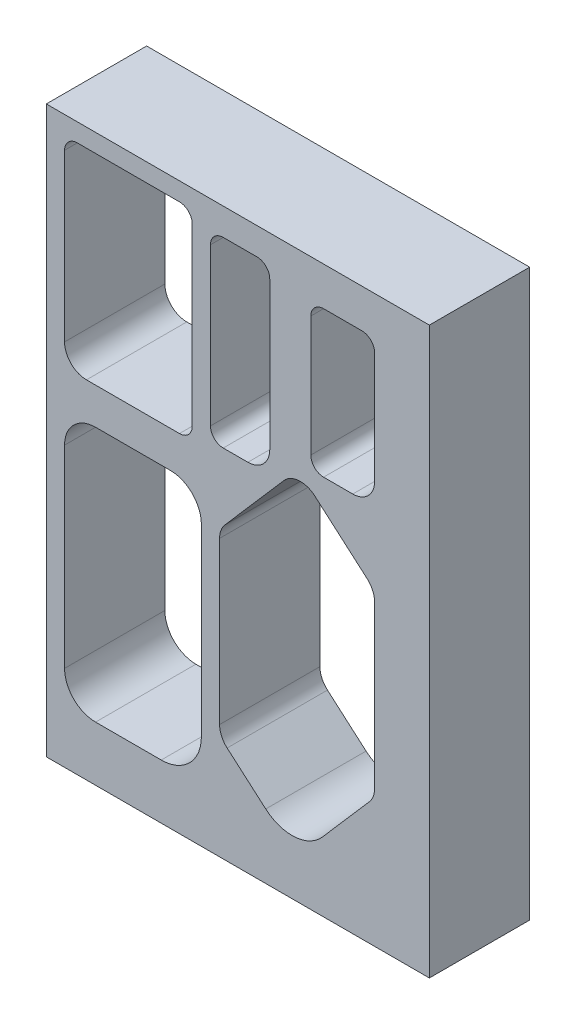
ISO-10303-21;
HEADER;
FILE_DESCRIPTION(('STEP AP214'),'2;1');
FILE_NAME('part.step','',(''),(''),'','','');
FILE_SCHEMA(('AUTOMOTIVE_DESIGN { 1 0 10303 214 1 1 1 1 }'));
ENDSEC;
DATA;
#1=APPLICATION_CONTEXT('core data for automotive mechanical design processes');
#2=APPLICATION_PROTOCOL_DEFINITION('international standard','automotive_design',2000,#1);
#3=PRODUCT_CONTEXT('',#1,'mechanical');
#4=PRODUCT('Part','Part','',(#3));
#5=PRODUCT_RELATED_PRODUCT_CATEGORY('part','',(#4));
#6=PRODUCT_DEFINITION_FORMATION('','',#4);
#7=PRODUCT_DEFINITION_CONTEXT('part definition',#1,'design');
#8=PRODUCT_DEFINITION('design','',#6,#7);
#9=PRODUCT_DEFINITION_SHAPE('','',#8);
#10=(LENGTH_UNIT() NAMED_UNIT(*) SI_UNIT(.MILLI.,.METRE.));
#11=(NAMED_UNIT(*) PLANE_ANGLE_UNIT() SI_UNIT($,.RADIAN.));
#12=(NAMED_UNIT(*) SI_UNIT($,.STERADIAN.) SOLID_ANGLE_UNIT());
#13=UNCERTAINTY_MEASURE_WITH_UNIT(LENGTH_MEASURE(1.E-05),#10,'distance_accuracy_value','');
#14=(GEOMETRIC_REPRESENTATION_CONTEXT(3) GLOBAL_UNCERTAINTY_ASSIGNED_CONTEXT((#13)) GLOBAL_UNIT_ASSIGNED_CONTEXT((#10,
#11,#12)) REPRESENTATION_CONTEXT('',''));
#15=CARTESIAN_POINT('',(0.,0.,0.));
#16=DIRECTION('',(0.,0.,1.));
#17=DIRECTION('',(1.,0.,0.));
#18=AXIS2_PLACEMENT_3D('',#15,#16,#17);
#19=CARTESIAN_POINT('',(19.05,-19.05,-272.689894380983));
#20=DIRECTION('',(1.,0.,0.));
#21=DIRECTION('',(0.,0.,-1.));
#22=AXIS2_PLACEMENT_3D('',#19,#20,#21);
#23=PLANE('',#22);
#24=DIRECTION('',(0.,0.,1.));
#25=VECTOR('',#24,1.);
#26=CARTESIAN_POINT('',(19.05,-19.05,-272.689894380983));
#27=LINE('',#26,#25);
#28=CARTESIAN_POINT('',(19.05,-19.05,-34.925));
#29=VERTEX_POINT('',#28);
#30=CARTESIAN_POINT('',(19.05,-19.05,0.));
#31=VERTEX_POINT('',#30);
#32=EDGE_CURVE('E433',#29,#31,#27,.T.);
#33=ORIENTED_EDGE('',*,*,#32,.F.);
#34=DIRECTION('',(0.,1.,0.));
#35=VECTOR('',#34,1.);
#36=CARTESIAN_POINT('',(19.05,-19.05,-34.925));
#37=LINE('',#36,#35);
#38=CARTESIAN_POINT('',(19.05,177.8,-34.925));
#39=VERTEX_POINT('',#38);
#40=EDGE_CURVE('E266',#29,#39,#37,.T.);
#41=ORIENTED_EDGE('',*,*,#40,.T.);
#42=DIRECTION('',(0.,0.,1.));
#43=VECTOR('',#42,1.);
#44=CARTESIAN_POINT('',(19.05,177.8,-272.689894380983));
#45=LINE('',#44,#43);
#46=CARTESIAN_POINT('',(19.05,177.8,0.));
#47=VERTEX_POINT('',#46);
#48=EDGE_CURVE('E429',#39,#47,#45,.T.);
#49=ORIENTED_EDGE('',*,*,#48,.T.);
#50=DIRECTION('',(0.,1.,0.));
#51=VECTOR('',#50,1.);
#52=CARTESIAN_POINT('',(19.05,-19.05,0.));
#53=LINE('',#52,#51);
#54=EDGE_CURVE('E300',#31,#47,#53,.T.);
#55=ORIENTED_EDGE('',*,*,#54,.F.);
#56=EDGE_LOOP('',(#33,#41,#49,#55));
#57=FACE_BOUND('',#56,.T.);
#58=ADVANCED_FACE('F35',(#57),#23,.T.);
#59=CARTESIAN_POINT('',(19.05,-19.05,-272.689894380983));
#60=DIRECTION('',(0.,-1.,0.));
#61=DIRECTION('',(1.,0.,0.));
#62=AXIS2_PLACEMENT_3D('',#59,#60,#61);
#63=PLANE('',#62);
#64=DIRECTION('',(0.,0.,1.));
#65=VECTOR('',#64,1.);
#66=CARTESIAN_POINT('',(-114.3,-19.05,-272.689894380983));
#67=LINE('',#66,#65);
#68=CARTESIAN_POINT('',(-114.3,-19.05,-34.925));
#69=VERTEX_POINT('',#68);
#70=CARTESIAN_POINT('',(-114.3,-19.05,0.));
#71=VERTEX_POINT('',#70);
#72=EDGE_CURVE('E310',#69,#71,#67,.T.);
#73=ORIENTED_EDGE('',*,*,#72,.F.);
#74=DIRECTION('',(1.,0.,0.));
#75=VECTOR('',#74,1.);
#76=CARTESIAN_POINT('',(19.05,-19.05,-34.925));
#77=LINE('',#76,#75);
#78=EDGE_CURVE('E430',#69,#29,#77,.T.);
#79=ORIENTED_EDGE('',*,*,#78,.T.);
#80=ORIENTED_EDGE('',*,*,#32,.T.);
#81=DIRECTION('',(1.,0.,0.));
#82=VECTOR('',#81,1.);
#83=CARTESIAN_POINT('',(19.05,-19.05,0.));
#84=LINE('',#83,#82);
#85=EDGE_CURVE('E413',#71,#31,#84,.T.);
#86=ORIENTED_EDGE('',*,*,#85,.F.);
#87=EDGE_LOOP('',(#73,#79,#80,#86));
#88=FACE_BOUND('',#87,.T.);
#89=ADVANCED_FACE('F665',(#88),#63,.T.);
#90=CARTESIAN_POINT('',(-114.3,-19.05,-272.689894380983));
#91=DIRECTION('',(-1.,0.,0.));
#92=DIRECTION('',(0.,0.,1.));
#93=AXIS2_PLACEMENT_3D('',#90,#91,#92);
#94=PLANE('',#93);
#95=DIRECTION('',(0.,0.,1.));
#96=VECTOR('',#95,1.);
#97=CARTESIAN_POINT('',(-114.3,177.8,-272.689894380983));
#98=LINE('',#97,#96);
#99=CARTESIAN_POINT('',(-114.3,177.8,-34.925));
#100=VERTEX_POINT('',#99);
#101=CARTESIAN_POINT('',(-114.3,177.8,0.));
#102=VERTEX_POINT('',#101);
#103=EDGE_CURVE('E309',#100,#102,#98,.T.);
#104=ORIENTED_EDGE('',*,*,#103,.F.);
#105=DIRECTION('',(0.,-1.,0.));
#106=VECTOR('',#105,1.);
#107=CARTESIAN_POINT('',(-114.3,-19.05,-34.925));
#108=LINE('',#107,#106);
#109=EDGE_CURVE('E434',#100,#69,#108,.T.);
#110=ORIENTED_EDGE('',*,*,#109,.T.);
#111=ORIENTED_EDGE('',*,*,#72,.T.);
#112=DIRECTION('',(0.,-1.,0.));
#113=VECTOR('',#112,1.);
#114=CARTESIAN_POINT('',(-114.3,-19.05,0.));
#115=LINE('',#114,#113);
#116=EDGE_CURVE('E655',#102,#71,#115,.T.);
#117=ORIENTED_EDGE('',*,*,#116,.F.);
#118=EDGE_LOOP('',(#104,#110,#111,#117));
#119=FACE_BOUND('',#118,.T.);
#120=ADVANCED_FACE('F673',(#119),#94,.T.);
#121=CARTESIAN_POINT('',(19.05,177.8,-272.689894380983));
#122=DIRECTION('',(0.,1.,0.));
#123=DIRECTION('',(-1.,0.,0.));
#124=AXIS2_PLACEMENT_3D('',#121,#122,#123);
#125=PLANE('',#124);
#126=ORIENTED_EDGE('',*,*,#48,.F.);
#127=DIRECTION('',(-1.,0.,0.));
#128=VECTOR('',#127,1.);
#129=CARTESIAN_POINT('',(19.05,177.8,-34.925));
#130=LINE('',#129,#128);
#131=EDGE_CURVE('E54',#39,#100,#130,.T.);
#132=ORIENTED_EDGE('',*,*,#131,.T.);
#133=ORIENTED_EDGE('',*,*,#103,.T.);
#134=DIRECTION('',(-1.,0.,0.));
#135=VECTOR('',#134,1.);
#136=CARTESIAN_POINT('',(19.05,177.8,0.));
#137=LINE('',#136,#135);
#138=EDGE_CURVE('E303',#47,#102,#137,.T.);
#139=ORIENTED_EDGE('',*,*,#138,.F.);
#140=EDGE_LOOP('',(#126,#132,#133,#139));
#141=FACE_BOUND('',#140,.T.);
#142=ADVANCED_FACE('F670',(#141),#125,.T.);
#143=CARTESIAN_POINT('',(-100.33,109.22,-272.689894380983));
#144=DIRECTION('',(0.,0.,1.));
#145=DIRECTION('',(1.,0.,0.));
#146=AXIS2_PLACEMENT_3D('',#143,#144,#145);
#147=CYLINDRICAL_SURFACE('',#146,7.61999999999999);
#148=CARTESIAN_POINT('',(-100.33,109.22,-34.925));
#149=DIRECTION('',(0.,0.,-1.));
#150=DIRECTION('',(-1.,0.,0.));
#151=AXIS2_PLACEMENT_3D('',#148,#149,#150);
#152=CIRCLE('',#151,7.61999999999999);
#153=CARTESIAN_POINT('',(-107.95,109.22,-34.925));
#154=VERTEX_POINT('',#153);
#155=CARTESIAN_POINT('',(-100.33,101.6,-34.925));
#156=VERTEX_POINT('',#155);
#157=EDGE_CURVE('E311',#154,#156,#152,.F.);
#158=ORIENTED_EDGE('',*,*,#157,.F.);
#159=DIRECTION('',(0.,0.,1.));
#160=VECTOR('',#159,1.);
#161=CARTESIAN_POINT('',(-107.95,109.22,-272.689894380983));
#162=LINE('',#161,#160);
#163=CARTESIAN_POINT('',(-107.95,109.22,0.));
#164=VERTEX_POINT('',#163);
#165=EDGE_CURVE('E449',#154,#164,#162,.T.);
#166=ORIENTED_EDGE('',*,*,#165,.T.);
#167=CARTESIAN_POINT('',(-100.33,109.22,0.));
#168=DIRECTION('',(0.,0.,1.));
#169=DIRECTION('',(1.,0.,0.));
#170=AXIS2_PLACEMENT_3D('',#167,#168,#169);
#171=CIRCLE('',#170,7.61999999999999);
#172=CARTESIAN_POINT('',(-100.33,101.6,0.));
#173=VERTEX_POINT('',#172);
#174=EDGE_CURVE('E452',#164,#173,#171,.T.);
#175=ORIENTED_EDGE('',*,*,#174,.T.);
#176=DIRECTION('',(0.,0.,1.));
#177=VECTOR('',#176,1.);
#178=CARTESIAN_POINT('',(-100.33,101.6,-272.689894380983));
#179=LINE('',#178,#177);
#180=EDGE_CURVE('E471',#156,#173,#179,.T.);
#181=ORIENTED_EDGE('',*,*,#180,.F.);
#182=EDGE_LOOP('',(#158,#166,#175,#181));
#183=FACE_BOUND('',#182,.T.);
#184=ADVANCED_FACE('F705',(#183),#147,.F.);
#185=CARTESIAN_POINT('',(-107.950000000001,167.005,-272.689894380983));
#186=DIRECTION('',(-1.,0.,0.));
#187=DIRECTION('',(0.,-1.,0.));
#188=AXIS2_PLACEMENT_3D('',#185,#186,#187);
#189=PLANE('',#188);
#190=DIRECTION('',(0.,-1.,0.));
#191=VECTOR('',#190,1.);
#192=CARTESIAN_POINT('',(-107.950000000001,167.005,-34.925));
#193=LINE('',#192,#191);
#194=CARTESIAN_POINT('',(-107.950000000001,167.005,-34.925));
#195=VERTEX_POINT('',#194);
#196=EDGE_CURVE('E315',#195,#154,#193,.T.);
#197=ORIENTED_EDGE('',*,*,#196,.F.);
#198=DIRECTION('',(0.,0.,1.));
#199=VECTOR('',#198,1.);
#200=CARTESIAN_POINT('',(-107.950000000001,167.005,-272.689894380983));
#201=LINE('',#200,#199);
#202=CARTESIAN_POINT('',(-107.950000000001,167.005,0.));
#203=VERTEX_POINT('',#202);
#204=EDGE_CURVE('E453',#195,#203,#201,.T.);
#205=ORIENTED_EDGE('',*,*,#204,.T.);
#206=DIRECTION('',(0.,-1.,0.));
#207=VECTOR('',#206,1.);
#208=CARTESIAN_POINT('',(-107.950000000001,167.005,0.));
#209=LINE('',#208,#207);
#210=EDGE_CURVE('E455',#203,#164,#209,.T.);
#211=ORIENTED_EDGE('',*,*,#210,.T.);
#212=ORIENTED_EDGE('',*,*,#165,.F.);
#213=EDGE_LOOP('',(#197,#205,#211,#212));
#214=FACE_BOUND('',#213,.T.);
#215=ADVANCED_FACE('F691',(#214),#189,.F.);
#216=CARTESIAN_POINT('',(-103.505000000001,167.005,-272.689894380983));
#217=DIRECTION('',(0.,0.,1.));
#218=DIRECTION('',(1.,0.,0.));
#219=AXIS2_PLACEMENT_3D('',#216,#217,#218);
#220=CYLINDRICAL_SURFACE('',#219,4.44500000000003);
#221=CARTESIAN_POINT('',(-103.505000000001,167.005,-34.925));
#222=DIRECTION('',(0.,0.,-1.));
#223=DIRECTION('',(-1.,0.,0.));
#224=AXIS2_PLACEMENT_3D('',#221,#222,#223);
#225=CIRCLE('',#224,4.44500000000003);
#226=CARTESIAN_POINT('',(-103.505000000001,171.45,-34.925));
#227=VERTEX_POINT('',#226);
#228=EDGE_CURVE('E11',#227,#195,#225,.F.);
#229=ORIENTED_EDGE('',*,*,#228,.F.);
#230=DIRECTION('',(0.,0.,1.));
#231=VECTOR('',#230,1.);
#232=CARTESIAN_POINT('',(-103.505000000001,171.45,-272.689894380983));
#233=LINE('',#232,#231);
#234=CARTESIAN_POINT('',(-103.505000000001,171.45,0.));
#235=VERTEX_POINT('',#234);
#236=EDGE_CURVE('E456',#227,#235,#233,.T.);
#237=ORIENTED_EDGE('',*,*,#236,.T.);
#238=CARTESIAN_POINT('',(-103.505000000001,167.005,0.));
#239=DIRECTION('',(0.,0.,1.));
#240=DIRECTION('',(1.,0.,0.));
#241=AXIS2_PLACEMENT_3D('',#238,#239,#240);
#242=CIRCLE('',#241,4.44500000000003);
#243=EDGE_CURVE('E458',#235,#203,#242,.T.);
#244=ORIENTED_EDGE('',*,*,#243,.T.);
#245=ORIENTED_EDGE('',*,*,#204,.F.);
#246=EDGE_LOOP('',(#229,#237,#244,#245));
#247=FACE_BOUND('',#246,.T.);
#248=ADVANCED_FACE('F694',(#247),#220,.F.);
#249=CARTESIAN_POINT('',(-67.9450000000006,171.45,-272.689894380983));
#250=DIRECTION('',(0.,1.,0.));
#251=DIRECTION('',(-1.,0.,0.));
#252=AXIS2_PLACEMENT_3D('',#249,#250,#251);
#253=PLANE('',#252);
#254=DIRECTION('',(-1.,0.,0.));
#255=VECTOR('',#254,1.);
#256=CARTESIAN_POINT('',(-67.9450000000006,171.45,-34.925));
#257=LINE('',#256,#255);
#258=CARTESIAN_POINT('',(-67.9450000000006,171.45,-34.925));
#259=VERTEX_POINT('',#258);
#260=EDGE_CURVE('E45',#259,#227,#257,.T.);
#261=ORIENTED_EDGE('',*,*,#260,.F.);
#262=DIRECTION('',(0.,0.,1.));
#263=VECTOR('',#262,1.);
#264=CARTESIAN_POINT('',(-67.9450000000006,171.45,-272.689894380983));
#265=LINE('',#264,#263);
#266=CARTESIAN_POINT('',(-67.9450000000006,171.45,0.));
#267=VERTEX_POINT('',#266);
#268=EDGE_CURVE('E459',#259,#267,#265,.T.);
#269=ORIENTED_EDGE('',*,*,#268,.T.);
#270=DIRECTION('',(-1.,0.,0.));
#271=VECTOR('',#270,1.);
#272=CARTESIAN_POINT('',(-67.9450000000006,171.45,0.));
#273=LINE('',#272,#271);
#274=EDGE_CURVE('E461',#267,#235,#273,.T.);
#275=ORIENTED_EDGE('',*,*,#274,.T.);
#276=ORIENTED_EDGE('',*,*,#236,.F.);
#277=EDGE_LOOP('',(#261,#269,#275,#276));
#278=FACE_BOUND('',#277,.T.);
#279=ADVANCED_FACE('F823',(#278),#253,.F.);
#280=CARTESIAN_POINT('',(-67.9450000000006,167.005,-272.689894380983));
#281=DIRECTION('',(0.,0.,1.));
#282=DIRECTION('',(1.,0.,0.));
#283=AXIS2_PLACEMENT_3D('',#280,#281,#282);
#284=CYLINDRICAL_SURFACE('',#283,4.445);
#285=CARTESIAN_POINT('',(-67.9450000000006,167.005,-34.925));
#286=DIRECTION('',(0.,0.,-1.));
#287=DIRECTION('',(-1.,0.,0.));
#288=AXIS2_PLACEMENT_3D('',#285,#286,#287);
#289=CIRCLE('',#288,4.445);
#290=CARTESIAN_POINT('',(-63.5000000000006,167.005,-34.925));
#291=VERTEX_POINT('',#290);
#292=EDGE_CURVE('E321',#291,#259,#289,.F.);
#293=ORIENTED_EDGE('',*,*,#292,.F.);
#294=DIRECTION('',(0.,0.,1.));
#295=VECTOR('',#294,1.);
#296=CARTESIAN_POINT('',(-63.5000000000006,167.005,-272.689894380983));
#297=LINE('',#296,#295);
#298=CARTESIAN_POINT('',(-63.5000000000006,167.005,0.));
#299=VERTEX_POINT('',#298);
#300=EDGE_CURVE('E462',#291,#299,#297,.T.);
#301=ORIENTED_EDGE('',*,*,#300,.T.);
#302=CARTESIAN_POINT('',(-67.9450000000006,167.005,0.));
#303=DIRECTION('',(0.,0.,1.));
#304=DIRECTION('',(1.,0.,0.));
#305=AXIS2_PLACEMENT_3D('',#302,#303,#304);
#306=CIRCLE('',#305,4.445);
#307=EDGE_CURVE('E464',#299,#267,#306,.T.);
#308=ORIENTED_EDGE('',*,*,#307,.T.);
#309=ORIENTED_EDGE('',*,*,#268,.F.);
#310=EDGE_LOOP('',(#293,#301,#308,#309));
#311=FACE_BOUND('',#310,.T.);
#312=ADVANCED_FACE('F724',(#311),#284,.F.);
#313=CARTESIAN_POINT('',(-63.5000000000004,106.045,-272.689894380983));
#314=DIRECTION('',(1.,0.,0.));
#315=DIRECTION('',(0.,1.,0.));
#316=AXIS2_PLACEMENT_3D('',#313,#314,#315);
#317=PLANE('',#316);
#318=DIRECTION('',(0.,1.,0.));
#319=VECTOR('',#318,1.);
#320=CARTESIAN_POINT('',(-63.5000000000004,106.045,-34.925));
#321=LINE('',#320,#319);
#322=CARTESIAN_POINT('',(-63.5000000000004,106.045,-34.925));
#323=VERTEX_POINT('',#322);
#324=EDGE_CURVE('E324',#323,#291,#321,.T.);
#325=ORIENTED_EDGE('',*,*,#324,.F.);
#326=DIRECTION('',(0.,0.,1.));
#327=VECTOR('',#326,1.);
#328=CARTESIAN_POINT('',(-63.5000000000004,106.045,-272.689894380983));
#329=LINE('',#328,#327);
#330=CARTESIAN_POINT('',(-63.5000000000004,106.045,0.));
#331=VERTEX_POINT('',#330);
#332=EDGE_CURVE('E465',#323,#331,#329,.T.);
#333=ORIENTED_EDGE('',*,*,#332,.T.);
#334=DIRECTION('',(0.,1.,0.));
#335=VECTOR('',#334,1.);
#336=CARTESIAN_POINT('',(-63.5000000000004,106.045,0.));
#337=LINE('',#336,#335);
#338=EDGE_CURVE('E467',#331,#299,#337,.T.);
#339=ORIENTED_EDGE('',*,*,#338,.T.);
#340=ORIENTED_EDGE('',*,*,#300,.F.);
#341=EDGE_LOOP('',(#325,#333,#339,#340));
#342=FACE_BOUND('',#341,.T.);
#343=ADVANCED_FACE('F718',(#342),#317,.F.);
#344=CARTESIAN_POINT('',(-67.9450000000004,106.045,-272.689894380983));
#345=DIRECTION('',(0.,0.,1.));
#346=DIRECTION('',(1.,0.,0.));
#347=AXIS2_PLACEMENT_3D('',#344,#345,#346);
#348=CYLINDRICAL_SURFACE('',#347,4.44500000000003);
#349=CARTESIAN_POINT('',(-67.9450000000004,106.045,-34.925));
#350=DIRECTION('',(0.,0.,-1.));
#351=DIRECTION('',(-1.,0.,0.));
#352=AXIS2_PLACEMENT_3D('',#349,#350,#351);
#353=CIRCLE('',#352,4.44500000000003);
#354=CARTESIAN_POINT('',(-67.9450000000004,101.6,-34.925));
#355=VERTEX_POINT('',#354);
#356=EDGE_CURVE('E327',#355,#323,#353,.F.);
#357=ORIENTED_EDGE('',*,*,#356,.F.);
#358=DIRECTION('',(0.,0.,1.));
#359=VECTOR('',#358,1.);
#360=CARTESIAN_POINT('',(-67.9450000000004,101.6,-272.689894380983));
#361=LINE('',#360,#359);
#362=CARTESIAN_POINT('',(-67.9450000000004,101.6,0.));
#363=VERTEX_POINT('',#362);
#364=EDGE_CURVE('E468',#355,#363,#361,.T.);
#365=ORIENTED_EDGE('',*,*,#364,.T.);
#366=CARTESIAN_POINT('',(-67.9450000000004,106.045,0.));
#367=DIRECTION('',(0.,0.,1.));
#368=DIRECTION('',(1.,0.,0.));
#369=AXIS2_PLACEMENT_3D('',#366,#367,#368);
#370=CIRCLE('',#369,4.44500000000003);
#371=EDGE_CURVE('E470',#363,#331,#370,.T.);
#372=ORIENTED_EDGE('',*,*,#371,.T.);
#373=ORIENTED_EDGE('',*,*,#332,.F.);
#374=EDGE_LOOP('',(#357,#365,#372,#373));
#375=FACE_BOUND('',#374,.T.);
#376=ADVANCED_FACE('F715',(#375),#348,.F.);
#377=CARTESIAN_POINT('',(-100.33,101.6,-272.689894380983));
#378=DIRECTION('',(0.,-1.,0.));
#379=DIRECTION('',(1.,0.,0.));
#380=AXIS2_PLACEMENT_3D('',#377,#378,#379);
#381=PLANE('',#380);
#382=DIRECTION('',(1.,0.,0.));
#383=VECTOR('',#382,1.);
#384=CARTESIAN_POINT('',(-100.33,101.6,-34.925));
#385=LINE('',#384,#383);
#386=EDGE_CURVE('E314',#156,#355,#385,.T.);
#387=ORIENTED_EDGE('',*,*,#386,.F.);
#388=ORIENTED_EDGE('',*,*,#180,.T.);
#389=DIRECTION('',(1.,0.,0.));
#390=VECTOR('',#389,1.);
#391=CARTESIAN_POINT('',(-100.33,101.6,0.));
#392=LINE('',#391,#390);
#393=EDGE_CURVE('E473',#173,#363,#392,.T.);
#394=ORIENTED_EDGE('',*,*,#393,.T.);
#395=ORIENTED_EDGE('',*,*,#364,.F.);
#396=EDGE_LOOP('',(#387,#388,#394,#395));
#397=FACE_BOUND('',#396,.T.);
#398=ADVANCED_FACE('F709',(#397),#381,.F.);
#399=CARTESIAN_POINT('',(-97.155,78.1050000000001,-272.689894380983));
#400=DIRECTION('',(0.,0.,1.));
#401=DIRECTION('',(1.,0.,0.));
#402=AXIS2_PLACEMENT_3D('',#399,#400,#401);
#403=CYLINDRICAL_SURFACE('',#402,10.795);
#404=CARTESIAN_POINT('',(-97.155,78.1050000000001,-34.925));
#405=DIRECTION('',(0.,0.,-1.));
#406=DIRECTION('',(-1.,0.,0.));
#407=AXIS2_PLACEMENT_3D('',#404,#405,#406);
#408=CIRCLE('',#407,10.795);
#409=CARTESIAN_POINT('',(-97.155,88.9000000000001,-34.925));
#410=VERTEX_POINT('',#409);
#411=CARTESIAN_POINT('',(-107.95,78.1050000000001,-34.925));
#412=VERTEX_POINT('',#411);
#413=EDGE_CURVE('E330',#410,#412,#408,.F.);
#414=ORIENTED_EDGE('',*,*,#413,.F.);
#415=DIRECTION('',(0.,0.,1.));
#416=VECTOR('',#415,1.);
#417=CARTESIAN_POINT('',(-97.155,88.9000000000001,-272.689894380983));
#418=LINE('',#417,#416);
#419=CARTESIAN_POINT('',(-97.155,88.9000000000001,0.));
#420=VERTEX_POINT('',#419);
#421=EDGE_CURVE('E474',#410,#420,#418,.T.);
#422=ORIENTED_EDGE('',*,*,#421,.T.);
#423=CARTESIAN_POINT('',(-97.155,78.1050000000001,0.));
#424=DIRECTION('',(0.,0.,1.));
#425=DIRECTION('',(1.,0.,0.));
#426=AXIS2_PLACEMENT_3D('',#423,#424,#425);
#427=CIRCLE('',#426,10.795);
#428=CARTESIAN_POINT('',(-107.95,78.1050000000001,0.));
#429=VERTEX_POINT('',#428);
#430=EDGE_CURVE('E476',#420,#429,#427,.T.);
#431=ORIENTED_EDGE('',*,*,#430,.T.);
#432=DIRECTION('',(0.,0.,1.));
#433=VECTOR('',#432,1.);
#434=CARTESIAN_POINT('',(-107.95,78.1050000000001,-272.689894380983));
#435=LINE('',#434,#433);
#436=EDGE_CURVE('E495',#412,#429,#435,.T.);
#437=ORIENTED_EDGE('',*,*,#436,.F.);
#438=EDGE_LOOP('',(#414,#422,#431,#437));
#439=FACE_BOUND('',#438,.T.);
#440=ADVANCED_FACE('F816',(#439),#403,.F.);
#441=CARTESIAN_POINT('',(-71.12,88.9000000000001,-272.689894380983));
#442=DIRECTION('',(0.,1.,0.));
#443=DIRECTION('',(-1.,0.,0.));
#444=AXIS2_PLACEMENT_3D('',#441,#442,#443);
#445=PLANE('',#444);
#446=DIRECTION('',(-1.,0.,0.));
#447=VECTOR('',#446,1.);
#448=CARTESIAN_POINT('',(-71.12,88.9000000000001,-34.925));
#449=LINE('',#448,#447);
#450=CARTESIAN_POINT('',(-71.12,88.9000000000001,-34.925));
#451=VERTEX_POINT('',#450);
#452=EDGE_CURVE('E334',#451,#410,#449,.T.);
#453=ORIENTED_EDGE('',*,*,#452,.F.);
#454=DIRECTION('',(0.,0.,1.));
#455=VECTOR('',#454,1.);
#456=CARTESIAN_POINT('',(-71.12,88.9000000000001,-272.689894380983));
#457=LINE('',#456,#455);
#458=CARTESIAN_POINT('',(-71.12,88.9000000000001,0.));
#459=VERTEX_POINT('',#458);
#460=EDGE_CURVE('E477',#451,#459,#457,.T.);
#461=ORIENTED_EDGE('',*,*,#460,.T.);
#462=DIRECTION('',(-1.,0.,0.));
#463=VECTOR('',#462,1.);
#464=CARTESIAN_POINT('',(-71.12,88.9000000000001,0.));
#465=LINE('',#464,#463);
#466=EDGE_CURVE('E479',#459,#420,#465,.T.);
#467=ORIENTED_EDGE('',*,*,#466,.T.);
#468=ORIENTED_EDGE('',*,*,#421,.F.);
#469=EDGE_LOOP('',(#453,#461,#467,#468));
#470=FACE_BOUND('',#469,.T.);
#471=ADVANCED_FACE('F856',(#470),#445,.F.);
#472=CARTESIAN_POINT('',(-71.12,78.1050000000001,-272.689894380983));
#473=DIRECTION('',(0.,0.,1.));
#474=DIRECTION('',(1.,0.,0.));
#475=AXIS2_PLACEMENT_3D('',#472,#473,#474);
#476=CYLINDRICAL_SURFACE('',#475,10.795);
#477=CARTESIAN_POINT('',(-71.12,78.1050000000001,-34.925));
#478=DIRECTION('',(0.,0.,-1.));
#479=DIRECTION('',(-1.,0.,0.));
#480=AXIS2_PLACEMENT_3D('',#477,#478,#479);
#481=CIRCLE('',#480,10.795);
#482=CARTESIAN_POINT('',(-60.325,78.1050000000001,-34.925));
#483=VERTEX_POINT('',#482);
#484=EDGE_CURVE('E317',#483,#451,#481,.F.);
#485=ORIENTED_EDGE('',*,*,#484,.F.);
#486=DIRECTION('',(0.,0.,1.));
#487=VECTOR('',#486,1.);
#488=CARTESIAN_POINT('',(-60.325,78.1050000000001,-272.689894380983));
#489=LINE('',#488,#487);
#490=CARTESIAN_POINT('',(-60.325,78.1050000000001,0.));
#491=VERTEX_POINT('',#490);
#492=EDGE_CURVE('E480',#483,#491,#489,.T.);
#493=ORIENTED_EDGE('',*,*,#492,.T.);
#494=CARTESIAN_POINT('',(-71.12,78.1050000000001,0.));
#495=DIRECTION('',(0.,0.,1.));
#496=DIRECTION('',(1.,0.,0.));
#497=AXIS2_PLACEMENT_3D('',#494,#495,#496);
#498=CIRCLE('',#497,10.795);
#499=EDGE_CURVE('E482',#491,#459,#498,.T.);
#500=ORIENTED_EDGE('',*,*,#499,.T.);
#501=ORIENTED_EDGE('',*,*,#460,.F.);
#502=EDGE_LOOP('',(#485,#493,#500,#501));
#503=FACE_BOUND('',#502,.T.);
#504=ADVANCED_FACE('F852',(#503),#476,.F.);
#505=CARTESIAN_POINT('',(-60.325,13.9700000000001,-272.689894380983));
#506=DIRECTION('',(1.,0.,0.));
#507=DIRECTION('',(0.,1.,0.));
#508=AXIS2_PLACEMENT_3D('',#505,#506,#507);
#509=PLANE('',#508);
#510=DIRECTION('',(0.,1.,0.));
#511=VECTOR('',#510,1.);
#512=CARTESIAN_POINT('',(-60.325,13.9700000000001,-34.925));
#513=LINE('',#512,#511);
#514=CARTESIAN_POINT('',(-60.325,13.9700000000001,-34.925));
#515=VERTEX_POINT('',#514);
#516=EDGE_CURVE('E340',#515,#483,#513,.T.);
#517=ORIENTED_EDGE('',*,*,#516,.F.);
#518=DIRECTION('',(0.,0.,1.));
#519=VECTOR('',#518,1.);
#520=CARTESIAN_POINT('',(-60.325,13.9700000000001,-272.689894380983));
#521=LINE('',#520,#519);
#522=CARTESIAN_POINT('',(-60.325,13.9700000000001,0.));
#523=VERTEX_POINT('',#522);
#524=EDGE_CURVE('E483',#515,#523,#521,.T.);
#525=ORIENTED_EDGE('',*,*,#524,.T.);
#526=DIRECTION('',(0.,1.,0.));
#527=VECTOR('',#526,1.);
#528=CARTESIAN_POINT('',(-60.325,13.9700000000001,0.));
#529=LINE('',#528,#527);
#530=EDGE_CURVE('E485',#523,#491,#529,.T.);
#531=ORIENTED_EDGE('',*,*,#530,.T.);
#532=ORIENTED_EDGE('',*,*,#492,.F.);
#533=EDGE_LOOP('',(#517,#525,#531,#532));
#534=FACE_BOUND('',#533,.T.);
#535=ADVANCED_FACE('F848',(#534),#509,.F.);
#536=CARTESIAN_POINT('',(-74.295,13.9700000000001,-272.689894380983));
#537=DIRECTION('',(0.,0.,1.));
#538=DIRECTION('',(1.,0.,0.));
#539=AXIS2_PLACEMENT_3D('',#536,#537,#538);
#540=CYLINDRICAL_SURFACE('',#539,13.97);
#541=CARTESIAN_POINT('',(-74.295,13.9700000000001,-34.925));
#542=DIRECTION('',(0.,0.,-1.));
#543=DIRECTION('',(-1.,0.,0.));
#544=AXIS2_PLACEMENT_3D('',#541,#542,#543);
#545=CIRCLE('',#544,13.97);
#546=CARTESIAN_POINT('',(-74.295,1.66533453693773E-13,-34.925));
#547=VERTEX_POINT('',#546);
#548=EDGE_CURVE('E343',#547,#515,#545,.F.);
#549=ORIENTED_EDGE('',*,*,#548,.F.);
#550=DIRECTION('',(0.,0.,1.));
#551=VECTOR('',#550,1.);
#552=CARTESIAN_POINT('',(-74.295,1.66533453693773E-13,-272.689894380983));
#553=LINE('',#552,#551);
#554=CARTESIAN_POINT('',(-74.295,1.66533453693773E-13,0.));
#555=VERTEX_POINT('',#554);
#556=EDGE_CURVE('E486',#547,#555,#553,.T.);
#557=ORIENTED_EDGE('',*,*,#556,.T.);
#558=CARTESIAN_POINT('',(-74.295,13.9700000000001,0.));
#559=DIRECTION('',(0.,0.,1.));
#560=DIRECTION('',(1.,0.,0.));
#561=AXIS2_PLACEMENT_3D('',#558,#559,#560);
#562=CIRCLE('',#561,13.97);
#563=EDGE_CURVE('E488',#555,#523,#562,.T.);
#564=ORIENTED_EDGE('',*,*,#563,.T.);
#565=ORIENTED_EDGE('',*,*,#524,.F.);
#566=EDGE_LOOP('',(#549,#557,#564,#565));
#567=FACE_BOUND('',#566,.T.);
#568=ADVANCED_FACE('F844',(#567),#540,.F.);
#569=CARTESIAN_POINT('',(-97.155,1.66533453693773E-13,-272.689894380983));
#570=DIRECTION('',(0.,-1.,0.));
#571=DIRECTION('',(1.,0.,0.));
#572=AXIS2_PLACEMENT_3D('',#569,#570,#571);
#573=PLANE('',#572);
#574=DIRECTION('',(1.,0.,0.));
#575=VECTOR('',#574,1.);
#576=CARTESIAN_POINT('',(-97.155,1.66533453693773E-13,-34.925));
#577=LINE('',#576,#575);
#578=CARTESIAN_POINT('',(-97.155,1.66533453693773E-13,-34.925));
#579=VERTEX_POINT('',#578);
#580=EDGE_CURVE('E346',#579,#547,#577,.T.);
#581=ORIENTED_EDGE('',*,*,#580,.F.);
#582=DIRECTION('',(0.,0.,1.));
#583=VECTOR('',#582,1.);
#584=CARTESIAN_POINT('',(-97.155,1.66533453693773E-13,-272.689894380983));
#585=LINE('',#584,#583);
#586=CARTESIAN_POINT('',(-97.155,1.66533453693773E-13,0.));
#587=VERTEX_POINT('',#586);
#588=EDGE_CURVE('E489',#579,#587,#585,.T.);
#589=ORIENTED_EDGE('',*,*,#588,.T.);
#590=DIRECTION('',(1.,0.,0.));
#591=VECTOR('',#590,1.);
#592=CARTESIAN_POINT('',(-97.155,1.66533453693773E-13,0.));
#593=LINE('',#592,#591);
#594=EDGE_CURVE('E491',#587,#555,#593,.T.);
#595=ORIENTED_EDGE('',*,*,#594,.T.);
#596=ORIENTED_EDGE('',*,*,#556,.F.);
#597=EDGE_LOOP('',(#581,#589,#595,#596));
#598=FACE_BOUND('',#597,.T.);
#599=ADVANCED_FACE('F840',(#598),#573,.F.);
#600=CARTESIAN_POINT('',(-97.155,10.7950000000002,-272.689894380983));
#601=DIRECTION('',(0.,0.,1.));
#602=DIRECTION('',(1.,0.,0.));
#603=AXIS2_PLACEMENT_3D('',#600,#601,#602);
#604=CYLINDRICAL_SURFACE('',#603,10.795);
#605=CARTESIAN_POINT('',(-97.155,10.7950000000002,-34.925));
#606=DIRECTION('',(0.,0.,-1.));
#607=DIRECTION('',(-1.,0.,0.));
#608=AXIS2_PLACEMENT_3D('',#605,#606,#607);
#609=CIRCLE('',#608,10.795);
#610=CARTESIAN_POINT('',(-107.95,10.7950000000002,-34.925));
#611=VERTEX_POINT('',#610);
#612=EDGE_CURVE('E349',#611,#579,#609,.F.);
#613=ORIENTED_EDGE('',*,*,#612,.F.);
#614=DIRECTION('',(0.,0.,1.));
#615=VECTOR('',#614,1.);
#616=CARTESIAN_POINT('',(-107.95,10.7950000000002,-272.689894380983));
#617=LINE('',#616,#615);
#618=CARTESIAN_POINT('',(-107.95,10.7950000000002,0.));
#619=VERTEX_POINT('',#618);
#620=EDGE_CURVE('E492',#611,#619,#617,.T.);
#621=ORIENTED_EDGE('',*,*,#620,.T.);
#622=CARTESIAN_POINT('',(-97.155,10.7950000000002,0.));
#623=DIRECTION('',(0.,0.,1.));
#624=DIRECTION('',(1.,0.,0.));
#625=AXIS2_PLACEMENT_3D('',#622,#623,#624);
#626=CIRCLE('',#625,10.795);
#627=EDGE_CURVE('E494',#619,#587,#626,.T.);
#628=ORIENTED_EDGE('',*,*,#627,.T.);
#629=ORIENTED_EDGE('',*,*,#588,.F.);
#630=EDGE_LOOP('',(#613,#621,#628,#629));
#631=FACE_BOUND('',#630,.T.);
#632=ADVANCED_FACE('F836',(#631),#604,.F.);
#633=CARTESIAN_POINT('',(-107.95,78.1050000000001,-272.689894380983));
#634=DIRECTION('',(-1.,0.,0.));
#635=DIRECTION('',(0.,-1.,0.));
#636=AXIS2_PLACEMENT_3D('',#633,#634,#635);
#637=PLANE('',#636);
#638=DIRECTION('',(0.,-1.,0.));
#639=VECTOR('',#638,1.);
#640=CARTESIAN_POINT('',(-107.95,78.1050000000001,-34.925));
#641=LINE('',#640,#639);
#642=EDGE_CURVE('E333',#412,#611,#641,.T.);
#643=ORIENTED_EDGE('',*,*,#642,.F.);
#644=ORIENTED_EDGE('',*,*,#436,.T.);
#645=DIRECTION('',(0.,-1.,0.));
#646=VECTOR('',#645,1.);
#647=CARTESIAN_POINT('',(-107.95,78.1050000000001,0.));
#648=LINE('',#647,#646);
#649=EDGE_CURVE('E497',#429,#619,#648,.T.);
#650=ORIENTED_EDGE('',*,*,#649,.T.);
#651=ORIENTED_EDGE('',*,*,#620,.F.);
#652=EDGE_LOOP('',(#643,#644,#650,#651));
#653=FACE_BOUND('',#652,.T.);
#654=ADVANCED_FACE('F832',(#653),#637,.F.);
#655=CARTESIAN_POINT('',(-28.7540588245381,13.9699999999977,-272.689894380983));
#656=DIRECTION('',(0.,0.,1.));
#657=DIRECTION('',(1.,0.,0.));
#658=AXIS2_PLACEMENT_3D('',#655,#656,#657);
#659=CYLINDRICAL_SURFACE('',#658,13.9699999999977);
#660=CARTESIAN_POINT('',(-28.7540588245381,13.9699999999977,-34.925));
#661=DIRECTION('',(0.,0.,-1.));
#662=DIRECTION('',(-1.,0.,0.));
#663=AXIS2_PLACEMENT_3D('',#660,#661,#662);
#664=CIRCLE('',#663,13.9699999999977);
#665=CARTESIAN_POINT('',(-37.9140499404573,3.42222948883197,-34.925));
#666=VERTEX_POINT('',#665);
#667=CARTESIAN_POINT('',(-18.2062883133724,4.81000888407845,-34.925));
#668=VERTEX_POINT('',#667);
#669=EDGE_CURVE('E352',#666,#668,#664,.F.);
#670=ORIENTED_EDGE('',*,*,#669,.F.);
#671=DIRECTION('',(0.,0.,1.));
#672=VECTOR('',#671,1.);
#673=CARTESIAN_POINT('',(-37.9140499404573,3.42222948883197,-272.689894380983));
#674=LINE('',#673,#672);
#675=CARTESIAN_POINT('',(-37.9140499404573,3.42222948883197,0.));
#676=VERTEX_POINT('',#675);
#677=EDGE_CURVE('E498',#666,#676,#674,.T.);
#678=ORIENTED_EDGE('',*,*,#677,.T.);
#679=CARTESIAN_POINT('',(-28.7540588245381,13.9699999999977,0.));
#680=DIRECTION('',(0.,0.,1.));
#681=DIRECTION('',(1.,0.,0.));
#682=AXIS2_PLACEMENT_3D('',#679,#680,#681);
#683=CIRCLE('',#682,13.9699999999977);
#684=CARTESIAN_POINT('',(-18.2062883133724,4.81000888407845,0.));
#685=VERTEX_POINT('',#684);
#686=EDGE_CURVE('E500',#676,#685,#683,.T.);
#687=ORIENTED_EDGE('',*,*,#686,.T.);
#688=DIRECTION('',(0.,0.,1.));
#689=VECTOR('',#688,1.);
#690=CARTESIAN_POINT('',(-18.2062883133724,4.81000888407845,-272.689894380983));
#691=LINE('',#690,#689);
#692=EDGE_CURVE('E531',#668,#685,#691,.T.);
#693=ORIENTED_EDGE('',*,*,#692,.F.);
#694=EDGE_LOOP('',(#670,#678,#687,#693));
#695=FACE_BOUND('',#694,.T.);
#696=ADVANCED_FACE('F835',(#695),#659,.F.);
#697=CARTESIAN_POINT('',(-51.3513587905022,15.0915798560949,-272.689894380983));
#698=DIRECTION('',(-0.655690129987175,-0.755030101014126,0.));
#699=DIRECTION('',(0.755030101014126,-0.655690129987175,0.));
#700=AXIS2_PLACEMENT_3D('',#697,#698,#699);
#701=PLANE('',#700);
#702=DIRECTION('',(0.755030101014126,-0.655690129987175,0.));
#703=VECTOR('',#702,1.);
#704=CARTESIAN_POINT('',(-51.3513587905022,15.0915798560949,-34.925));
#705=LINE('',#704,#703);
#706=CARTESIAN_POINT('',(-51.3513587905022,15.0915798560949,-34.925));
#707=VERTEX_POINT('',#706);
#708=EDGE_CURVE('E356',#707,#666,#705,.T.);
#709=ORIENTED_EDGE('',*,*,#708,.F.);
#710=DIRECTION('',(0.,0.,1.));
#711=VECTOR('',#710,1.);
#712=CARTESIAN_POINT('',(-51.3513587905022,15.0915798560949,-272.689894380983));
#713=LINE('',#712,#711);
#714=CARTESIAN_POINT('',(-51.3513587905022,15.0915798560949,0.));
#715=VERTEX_POINT('',#714);
#716=EDGE_CURVE('E501',#707,#715,#713,.T.);
#717=ORIENTED_EDGE('',*,*,#716,.T.);
#718=DIRECTION('',(0.755030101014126,-0.655690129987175,0.));
#719=VECTOR('',#718,1.);
#720=CARTESIAN_POINT('',(-51.3513587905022,15.0915798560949,0.));
#721=LINE('',#720,#719);
#722=EDGE_CURVE('E503',#715,#676,#721,.T.);
#723=ORIENTED_EDGE('',*,*,#722,.T.);
#724=ORIENTED_EDGE('',*,*,#677,.F.);
#725=EDGE_LOOP('',(#709,#717,#723,#724));
#726=FACE_BOUND('',#725,.T.);
#727=ADVANCED_FACE('F904',(#726),#701,.F.);
#728=CARTESIAN_POINT('',(-46.355,20.8449092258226,-272.689894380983));
#729=DIRECTION('',(0.,0.,1.));
#730=DIRECTION('',(1.,0.,0.));
#731=AXIS2_PLACEMENT_3D('',#728,#729,#730);
#732=CYLINDRICAL_SURFACE('',#731,7.61999999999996);
#733=CARTESIAN_POINT('',(-46.355,20.8449092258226,-34.925));
#734=DIRECTION('',(0.,0.,-1.));
#735=DIRECTION('',(-1.,0.,0.));
#736=AXIS2_PLACEMENT_3D('',#733,#734,#735);
#737=CIRCLE('',#736,7.61999999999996);
#738=CARTESIAN_POINT('',(-53.975,20.8449092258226,-34.925));
#739=VERTEX_POINT('',#738);
#740=EDGE_CURVE('E337',#739,#707,#737,.F.);
#741=ORIENTED_EDGE('',*,*,#740,.F.);
#742=DIRECTION('',(0.,0.,1.));
#743=VECTOR('',#742,1.);
#744=CARTESIAN_POINT('',(-53.975,20.8449092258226,-272.689894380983));
#745=LINE('',#744,#743);
#746=CARTESIAN_POINT('',(-53.975,20.8449092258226,0.));
#747=VERTEX_POINT('',#746);
#748=EDGE_CURVE('E504',#739,#747,#745,.T.);
#749=ORIENTED_EDGE('',*,*,#748,.T.);
#750=CARTESIAN_POINT('',(-46.355,20.8449092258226,0.));
#751=DIRECTION('',(0.,0.,1.));
#752=DIRECTION('',(1.,0.,0.));
#753=AXIS2_PLACEMENT_3D('',#750,#751,#752);
#754=CIRCLE('',#753,7.61999999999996);
#755=EDGE_CURVE('E506',#747,#715,#754,.T.);
#756=ORIENTED_EDGE('',*,*,#755,.T.);
#757=ORIENTED_EDGE('',*,*,#716,.F.);
#758=EDGE_LOOP('',(#741,#749,#756,#757));
#759=FACE_BOUND('',#758,.T.);
#760=ADVANCED_FACE('F900',(#759),#732,.F.);
#761=CARTESIAN_POINT('',(-53.975,76.9887305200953,-272.689894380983));
#762=DIRECTION('',(-1.,0.,0.));
#763=DIRECTION('',(0.,-1.,0.));
#764=AXIS2_PLACEMENT_3D('',#761,#762,#763);
#765=PLANE('',#764);
#766=DIRECTION('',(0.,-1.,0.));
#767=VECTOR('',#766,1.);
#768=CARTESIAN_POINT('',(-53.975,76.9887305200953,-34.925));
#769=LINE('',#768,#767);
#770=CARTESIAN_POINT('',(-53.975,76.9887305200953,-34.925));
#771=VERTEX_POINT('',#770);
#772=EDGE_CURVE('E362',#771,#739,#769,.T.);
#773=ORIENTED_EDGE('',*,*,#772,.F.);
#774=DIRECTION('',(0.,0.,1.));
#775=VECTOR('',#774,1.);
#776=CARTESIAN_POINT('',(-53.975,76.9887305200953,-272.689894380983));
#777=LINE('',#776,#775);
#778=CARTESIAN_POINT('',(-53.975,76.9887305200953,0.));
#779=VERTEX_POINT('',#778);
#780=EDGE_CURVE('E507',#771,#779,#777,.T.);
#781=ORIENTED_EDGE('',*,*,#780,.T.);
#782=DIRECTION('',(0.,-1.,0.));
#783=VECTOR('',#782,1.);
#784=CARTESIAN_POINT('',(-53.975,76.9887305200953,0.));
#785=LINE('',#784,#783);
#786=EDGE_CURVE('E509',#779,#747,#785,.T.);
#787=ORIENTED_EDGE('',*,*,#786,.T.);
#788=ORIENTED_EDGE('',*,*,#748,.F.);
#789=EDGE_LOOP('',(#773,#781,#787,#788));
#790=FACE_BOUND('',#789,.T.);
#791=ADVANCED_FACE('F896',(#790),#765,.F.);
#792=CARTESIAN_POINT('',(-46.355,76.9887305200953,-272.689894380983));
#793=DIRECTION('',(0.,0.,1.));
#794=DIRECTION('',(1.,0.,0.));
#795=AXIS2_PLACEMENT_3D('',#792,#793,#794);
#796=CYLINDRICAL_SURFACE('',#795,7.6199999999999);
#797=CARTESIAN_POINT('',(-46.355,76.9887305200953,-34.925));
#798=DIRECTION('',(0.,0.,-1.));
#799=DIRECTION('',(-1.,0.,0.));
#800=AXIS2_PLACEMENT_3D('',#797,#798,#799);
#801=CIRCLE('',#800,7.6199999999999);
#802=CARTESIAN_POINT('',(-52.1083293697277,81.9850893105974,-34.925));
#803=VERTEX_POINT('',#802);
#804=EDGE_CURVE('E365',#803,#771,#801,.F.);
#805=ORIENTED_EDGE('',*,*,#804,.F.);
#806=DIRECTION('',(0.,0.,1.));
#807=VECTOR('',#806,1.);
#808=CARTESIAN_POINT('',(-52.1083293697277,81.9850893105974,-272.689894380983));
#809=LINE('',#808,#807);
#810=CARTESIAN_POINT('',(-52.1083293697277,81.9850893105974,0.));
#811=VERTEX_POINT('',#810);
#812=EDGE_CURVE('E510',#803,#811,#809,.T.);
#813=ORIENTED_EDGE('',*,*,#812,.T.);
#814=CARTESIAN_POINT('',(-46.355,76.9887305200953,0.));
#815=DIRECTION('',(0.,0.,1.));
#816=DIRECTION('',(1.,0.,0.));
#817=AXIS2_PLACEMENT_3D('',#814,#815,#816);
#818=CIRCLE('',#817,7.6199999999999);
#819=EDGE_CURVE('E512',#811,#779,#818,.T.);
#820=ORIENTED_EDGE('',*,*,#819,.T.);
#821=ORIENTED_EDGE('',*,*,#780,.F.);
#822=EDGE_LOOP('',(#805,#813,#820,#821));
#823=FACE_BOUND('',#822,.T.);
#824=ADVANCED_FACE('F892',(#823),#796,.F.);
#825=CARTESIAN_POINT('',(-31.605079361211,105.594672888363,-272.689894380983));
#826=DIRECTION('',(-0.755030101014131,0.65569012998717,0.));
#827=DIRECTION('',(-0.65569012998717,-0.755030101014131,0.));
#828=AXIS2_PLACEMENT_3D('',#825,#826,#827);
#829=PLANE('',#828);
#830=DIRECTION('',(-0.65569012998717,-0.755030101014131,0.));
#831=VECTOR('',#830,1.);
#832=CARTESIAN_POINT('',(-31.605079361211,105.594672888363,-34.925));
#833=LINE('',#832,#831);
#834=CARTESIAN_POINT('',(-31.605079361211,105.594672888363,-34.925));
#835=VERTEX_POINT('',#834);
#836=EDGE_CURVE('E368',#835,#803,#833,.T.);
#837=ORIENTED_EDGE('',*,*,#836,.F.);
#838=DIRECTION('',(0.,0.,1.));
#839=VECTOR('',#838,1.);
#840=CARTESIAN_POINT('',(-31.605079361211,105.594672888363,-272.689894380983));
#841=LINE('',#840,#839);
#842=CARTESIAN_POINT('',(-31.605079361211,105.594672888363,0.));
#843=VERTEX_POINT('',#842);
#844=EDGE_CURVE('E513',#835,#843,#841,.T.);
#845=ORIENTED_EDGE('',*,*,#844,.T.);
#846=DIRECTION('',(-0.65569012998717,-0.755030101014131,0.));
#847=VECTOR('',#846,1.);
#848=CARTESIAN_POINT('',(-31.605079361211,105.594672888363,0.));
#849=LINE('',#848,#847);
#850=EDGE_CURVE('E515',#843,#811,#849,.T.);
#851=ORIENTED_EDGE('',*,*,#850,.T.);
#852=ORIENTED_EDGE('',*,*,#812,.F.);
#853=EDGE_LOOP('',(#837,#845,#851,#852));
#854=FACE_BOUND('',#853,.T.);
#855=ADVANCED_FACE('F888',(#854),#829,.F.);
#856=CARTESIAN_POINT('',(-25.8517499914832,100.598314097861,-272.689894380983));
#857=DIRECTION('',(0.,0.,1.));
#858=DIRECTION('',(1.,0.,0.));
#859=AXIS2_PLACEMENT_3D('',#856,#857,#858);
#860=CYLINDRICAL_SURFACE('',#859,7.61999999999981);
#861=CARTESIAN_POINT('',(-25.8517499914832,100.598314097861,-34.925));
#862=DIRECTION('',(0.,0.,-1.));
#863=DIRECTION('',(-1.,0.,0.));
#864=AXIS2_PLACEMENT_3D('',#861,#862,#863);
#865=CIRCLE('',#864,7.61999999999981);
#866=CARTESIAN_POINT('',(-20.8553912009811,106.351643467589,-34.925));
#867=VERTEX_POINT('',#866);
#868=EDGE_CURVE('E371',#867,#835,#865,.F.);
#869=ORIENTED_EDGE('',*,*,#868,.F.);
#870=DIRECTION('',(0.,0.,1.));
#871=VECTOR('',#870,1.);
#872=CARTESIAN_POINT('',(-20.8553912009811,106.351643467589,-272.689894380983));
#873=LINE('',#872,#871);
#874=CARTESIAN_POINT('',(-20.8553912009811,106.351643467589,0.));
#875=VERTEX_POINT('',#874);
#876=EDGE_CURVE('E516',#867,#875,#873,.T.);
#877=ORIENTED_EDGE('',*,*,#876,.T.);
#878=CARTESIAN_POINT('',(-25.8517499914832,100.598314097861,0.));
#879=DIRECTION('',(0.,0.,1.));
#880=DIRECTION('',(1.,0.,0.));
#881=AXIS2_PLACEMENT_3D('',#878,#879,#880);
#882=CIRCLE('',#881,7.61999999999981);
#883=EDGE_CURVE('E518',#875,#843,#882,.T.);
#884=ORIENTED_EDGE('',*,*,#883,.T.);
#885=ORIENTED_EDGE('',*,*,#844,.F.);
#886=EDGE_LOOP('',(#869,#877,#884,#885));
#887=FACE_BOUND('',#886,.T.);
#888=ADVANCED_FACE('F884',(#887),#860,.F.);
#889=CARTESIAN_POINT('',(-2.62364120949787,90.5186607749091,-272.689894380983));
#890=DIRECTION('',(0.655690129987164,0.755030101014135,0.));
#891=DIRECTION('',(-0.755030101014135,0.655690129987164,0.));
#892=AXIS2_PLACEMENT_3D('',#889,#890,#891);
#893=PLANE('',#892);
#894=DIRECTION('',(-0.755030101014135,0.655690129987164,0.));
#895=VECTOR('',#894,1.);
#896=CARTESIAN_POINT('',(-2.62364120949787,90.5186607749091,-34.925));
#897=LINE('',#896,#895);
#898=CARTESIAN_POINT('',(-2.62364120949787,90.5186607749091,-34.925));
#899=VERTEX_POINT('',#898);
#900=EDGE_CURVE('E374',#899,#867,#897,.T.);
#901=ORIENTED_EDGE('',*,*,#900,.F.);
#902=DIRECTION('',(0.,0.,1.));
#903=VECTOR('',#902,1.);
#904=CARTESIAN_POINT('',(-2.62364120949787,90.5186607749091,-272.689894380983));
#905=LINE('',#904,#903);
#906=CARTESIAN_POINT('',(-2.62364120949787,90.5186607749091,0.));
#907=VERTEX_POINT('',#906);
#908=EDGE_CURVE('E519',#899,#907,#905,.T.);
#909=ORIENTED_EDGE('',*,*,#908,.T.);
#910=DIRECTION('',(-0.755030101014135,0.655690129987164,0.));
#911=VECTOR('',#910,1.);
#912=CARTESIAN_POINT('',(-2.62364120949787,90.5186607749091,0.));
#913=LINE('',#912,#911);
#914=EDGE_CURVE('E521',#907,#875,#913,.T.);
#915=ORIENTED_EDGE('',*,*,#914,.T.);
#916=ORIENTED_EDGE('',*,*,#876,.F.);
#917=EDGE_LOOP('',(#901,#909,#915,#916));
#918=FACE_BOUND('',#917,.T.);
#919=ADVANCED_FACE('F880',(#918),#893,.F.);
#920=CARTESIAN_POINT('',(-7.62000000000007,84.7653314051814,-272.689894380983));
#921=DIRECTION('',(0.,0.,1.));
#922=DIRECTION('',(1.,0.,0.));
#923=AXIS2_PLACEMENT_3D('',#920,#921,#922);
#924=CYLINDRICAL_SURFACE('',#923,7.61999999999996);
#925=CARTESIAN_POINT('',(-7.62000000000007,84.7653314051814,-34.925));
#926=DIRECTION('',(0.,0.,-1.));
#927=DIRECTION('',(-1.,0.,0.));
#928=AXIS2_PLACEMENT_3D('',#925,#926,#927);
#929=CIRCLE('',#928,7.61999999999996);
#930=CARTESIAN_POINT('',(-1.11022302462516E-13,84.7653314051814,-34.925));
#931=VERTEX_POINT('',#930);
#932=EDGE_CURVE('E377',#931,#899,#929,.F.);
#933=ORIENTED_EDGE('',*,*,#932,.F.);
#934=DIRECTION('',(0.,0.,1.));
#935=VECTOR('',#934,1.);
#936=CARTESIAN_POINT('',(-1.11022302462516E-13,84.7653314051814,-272.689894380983));
#937=LINE('',#936,#935);
#938=CARTESIAN_POINT('',(-1.11022302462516E-13,84.7653314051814,0.));
#939=VERTEX_POINT('',#938);
#940=EDGE_CURVE('E522',#931,#939,#937,.T.);
#941=ORIENTED_EDGE('',*,*,#940,.T.);
#942=CARTESIAN_POINT('',(-7.62000000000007,84.7653314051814,0.));
#943=DIRECTION('',(0.,0.,1.));
#944=DIRECTION('',(1.,0.,0.));
#945=AXIS2_PLACEMENT_3D('',#942,#943,#944);
#946=CIRCLE('',#945,7.61999999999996);
#947=EDGE_CURVE('E524',#939,#907,#946,.T.);
#948=ORIENTED_EDGE('',*,*,#947,.T.);
#949=ORIENTED_EDGE('',*,*,#908,.F.);
#950=EDGE_LOOP('',(#933,#941,#948,#949));
#951=FACE_BOUND('',#950,.T.);
#952=ADVANCED_FACE('F876',(#951),#924,.F.);
#953=CARTESIAN_POINT('',(-1.94289029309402E-13,28.6215101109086,-272.689894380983));
#954=DIRECTION('',(1.,0.,0.));
#955=DIRECTION('',(0.,1.,0.));
#956=AXIS2_PLACEMENT_3D('',#953,#954,#955);
#957=PLANE('',#956);
#958=DIRECTION('',(0.,1.,0.));
#959=VECTOR('',#958,1.);
#960=CARTESIAN_POINT('',(-1.94289029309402E-13,28.6215101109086,-34.925));
#961=LINE('',#960,#959);
#962=CARTESIAN_POINT('',(-1.94289029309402E-13,28.6215101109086,-34.925));
#963=VERTEX_POINT('',#962);
#964=EDGE_CURVE('E380',#963,#931,#961,.T.);
#965=ORIENTED_EDGE('',*,*,#964,.F.);
#966=DIRECTION('',(0.,0.,1.));
#967=VECTOR('',#966,1.);
#968=CARTESIAN_POINT('',(-1.94289029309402E-13,28.6215101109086,-272.689894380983));
#969=LINE('',#968,#967);
#970=CARTESIAN_POINT('',(-1.94289029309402E-13,28.6215101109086,0.));
#971=VERTEX_POINT('',#970);
#972=EDGE_CURVE('E525',#963,#971,#969,.T.);
#973=ORIENTED_EDGE('',*,*,#972,.T.);
#974=DIRECTION('',(0.,1.,0.));
#975=VECTOR('',#974,1.);
#976=CARTESIAN_POINT('',(-1.94289029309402E-13,28.6215101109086,0.));
#977=LINE('',#976,#975);
#978=EDGE_CURVE('E527',#971,#939,#977,.T.);
#979=ORIENTED_EDGE('',*,*,#978,.T.);
#980=ORIENTED_EDGE('',*,*,#940,.F.);
#981=EDGE_LOOP('',(#965,#973,#979,#980));
#982=FACE_BOUND('',#981,.T.);
#983=ADVANCED_FACE('F872',(#982),#957,.F.);
#984=CARTESIAN_POINT('',(-7.62000000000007,28.6215101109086,-272.689894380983));
#985=DIRECTION('',(0.,0.,1.));
#986=DIRECTION('',(1.,0.,0.));
#987=AXIS2_PLACEMENT_3D('',#984,#985,#986);
#988=CYLINDRICAL_SURFACE('',#987,7.61999999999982);
#989=CARTESIAN_POINT('',(-7.62000000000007,28.6215101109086,-34.925));
#990=DIRECTION('',(0.,0.,-1.));
#991=DIRECTION('',(-1.,0.,0.));
#992=AXIS2_PLACEMENT_3D('',#989,#990,#991);
#993=CIRCLE('',#992,7.61999999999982);
#994=CARTESIAN_POINT('',(-1.8666706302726,23.6251513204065,-34.925));
#995=VERTEX_POINT('',#994);
#996=EDGE_CURVE('E383',#995,#963,#993,.F.);
#997=ORIENTED_EDGE('',*,*,#996,.F.);
#998=DIRECTION('',(0.,0.,1.));
#999=VECTOR('',#998,1.);
#1000=CARTESIAN_POINT('',(-1.86667063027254,23.6251513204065,-272.689894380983));
#1001=LINE('',#1000,#999);
#1002=CARTESIAN_POINT('',(-1.86667063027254,23.6251513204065,0.));
#1003=VERTEX_POINT('',#1002);
#1004=EDGE_CURVE('E528',#995,#1003,#1001,.T.);
#1005=ORIENTED_EDGE('',*,*,#1004,.T.);
#1006=CARTESIAN_POINT('',(-7.62000000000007,28.6215101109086,0.));
#1007=DIRECTION('',(0.,0.,1.));
#1008=DIRECTION('',(1.,0.,0.));
#1009=AXIS2_PLACEMENT_3D('',#1006,#1007,#1008);
#1010=CIRCLE('',#1009,7.61999999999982);
#1011=EDGE_CURVE('E530',#1003,#971,#1010,.T.);
#1012=ORIENTED_EDGE('',*,*,#1011,.T.);
#1013=ORIENTED_EDGE('',*,*,#972,.F.);
#1014=EDGE_LOOP('',(#997,#1005,#1012,#1013));
#1015=FACE_BOUND('',#1014,.T.);
#1016=ADVANCED_FACE('F868',(#1015),#988,.F.);
#1017=CARTESIAN_POINT('',(-18.2062883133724,4.81000888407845,-272.689894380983));
#1018=DIRECTION('',(0.755030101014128,-0.655690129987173,0.));
#1019=DIRECTION('',(0.655690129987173,0.755030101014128,0.));
#1020=AXIS2_PLACEMENT_3D('',#1017,#1018,#1019);
#1021=PLANE('',#1020);
#1022=DIRECTION('',(0.655690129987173,0.755030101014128,0.));
#1023=VECTOR('',#1022,1.);
#1024=CARTESIAN_POINT('',(-18.2062883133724,4.81000888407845,-34.925));
#1025=LINE('',#1024,#1023);
#1026=EDGE_CURVE('E355',#668,#995,#1025,.T.);
#1027=ORIENTED_EDGE('',*,*,#1026,.F.);
#1028=ORIENTED_EDGE('',*,*,#692,.T.);
#1029=DIRECTION('',(0.655690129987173,0.755030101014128,0.));
#1030=VECTOR('',#1029,1.);
#1031=CARTESIAN_POINT('',(-18.2062883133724,4.81000888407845,0.));
#1032=LINE('',#1031,#1030);
#1033=EDGE_CURVE('E533',#685,#1003,#1032,.T.);
#1034=ORIENTED_EDGE('',*,*,#1033,.T.);
#1035=ORIENTED_EDGE('',*,*,#1004,.F.);
#1036=EDGE_LOOP('',(#1027,#1028,#1034,#1035));
#1037=FACE_BOUND('',#1036,.T.);
#1038=ADVANCED_FACE('F864',(#1037),#1021,.F.);
#1039=CARTESIAN_POINT('',(-44.1325,112.475088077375,-272.689894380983));
#1040=DIRECTION('',(0.,0.,1.));
#1041=DIRECTION('',(1.,0.,0.));
#1042=AXIS2_PLACEMENT_3D('',#1039,#1040,#1041);
#1043=CYLINDRICAL_SURFACE('',#1042,7.61999999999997);
#1044=CARTESIAN_POINT('',(-44.1325,112.475088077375,-34.925));
#1045=DIRECTION('',(0.,0.,-1.));
#1046=DIRECTION('',(-1.,0.,0.));
#1047=AXIS2_PLACEMENT_3D('',#1044,#1045,#1046);
#1048=CIRCLE('',#1047,7.61999999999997);
#1049=CARTESIAN_POINT('',(-44.1325,104.855088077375,-34.925));
#1050=VERTEX_POINT('',#1049);
#1051=CARTESIAN_POINT('',(-36.5125,112.475088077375,-34.925));
#1052=VERTEX_POINT('',#1051);
#1053=EDGE_CURVE('E386',#1050,#1052,#1048,.F.);
#1054=ORIENTED_EDGE('',*,*,#1053,.F.);
#1055=DIRECTION('',(0.,0.,1.));
#1056=VECTOR('',#1055,1.);
#1057=CARTESIAN_POINT('',(-44.1325,104.855088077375,-272.689894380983));
#1058=LINE('',#1057,#1056);
#1059=CARTESIAN_POINT('',(-44.1325,104.855088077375,0.));
#1060=VERTEX_POINT('',#1059);
#1061=EDGE_CURVE('E534',#1050,#1060,#1058,.T.);
#1062=ORIENTED_EDGE('',*,*,#1061,.T.);
#1063=CARTESIAN_POINT('',(-44.1325,112.475088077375,0.));
#1064=DIRECTION('',(0.,0.,1.));
#1065=DIRECTION('',(1.,0.,0.));
#1066=AXIS2_PLACEMENT_3D('',#1063,#1064,#1065);
#1067=CIRCLE('',#1066,7.61999999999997);
#1068=CARTESIAN_POINT('',(-36.5125,112.475088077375,0.));
#1069=VERTEX_POINT('',#1068);
#1070=EDGE_CURVE('E536',#1060,#1069,#1067,.T.);
#1071=ORIENTED_EDGE('',*,*,#1070,.T.);
#1072=DIRECTION('',(0.,0.,1.));
#1073=VECTOR('',#1072,1.);
#1074=CARTESIAN_POINT('',(-36.5125,112.475088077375,-272.689894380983));
#1075=LINE('',#1074,#1073);
#1076=EDGE_CURVE('E92',#1052,#1069,#1075,.T.);
#1077=ORIENTED_EDGE('',*,*,#1076,.F.);
#1078=EDGE_LOOP('',(#1054,#1062,#1071,#1077));
#1079=FACE_BOUND('',#1078,.T.);
#1080=ADVANCED_FACE('F867',(#1079),#1043,.F.);
#1081=CARTESIAN_POINT('',(-52.7050000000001,104.855088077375,-272.689894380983));
#1082=DIRECTION('',(0.,-1.,0.));
#1083=DIRECTION('',(1.,0.,0.));
#1084=AXIS2_PLACEMENT_3D('',#1081,#1082,#1083);
#1085=PLANE('',#1084);
#1086=DIRECTION('',(1.,0.,0.));
#1087=VECTOR('',#1086,1.);
#1088=CARTESIAN_POINT('',(-52.7050000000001,104.855088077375,-34.925));
#1089=LINE('',#1088,#1087);
#1090=CARTESIAN_POINT('',(-52.7050000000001,104.855088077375,-34.925));
#1091=VERTEX_POINT('',#1090);
#1092=EDGE_CURVE('E390',#1091,#1050,#1089,.T.);
#1093=ORIENTED_EDGE('',*,*,#1092,.F.);
#1094=DIRECTION('',(0.,0.,1.));
#1095=VECTOR('',#1094,1.);
#1096=CARTESIAN_POINT('',(-52.7050000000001,104.855088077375,-272.689894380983));
#1097=LINE('',#1096,#1095);
#1098=CARTESIAN_POINT('',(-52.7050000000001,104.855088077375,0.));
#1099=VERTEX_POINT('',#1098);
#1100=EDGE_CURVE('E537',#1091,#1099,#1097,.T.);
#1101=ORIENTED_EDGE('',*,*,#1100,.T.);
#1102=DIRECTION('',(1.,0.,0.));
#1103=VECTOR('',#1102,1.);
#1104=CARTESIAN_POINT('',(-52.7050000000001,104.855088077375,0.));
#1105=LINE('',#1104,#1103);
#1106=EDGE_CURVE('E539',#1099,#1060,#1105,.T.);
#1107=ORIENTED_EDGE('',*,*,#1106,.T.);
#1108=ORIENTED_EDGE('',*,*,#1061,.F.);
#1109=EDGE_LOOP('',(#1093,#1101,#1107,#1108));
#1110=FACE_BOUND('',#1109,.T.);
#1111=ADVANCED_FACE('F934',(#1110),#1085,.F.);
#1112=CARTESIAN_POINT('',(-52.7050000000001,109.300088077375,-272.689894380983));
#1113=DIRECTION('',(0.,0.,1.));
#1114=DIRECTION('',(1.,0.,0.));
#1115=AXIS2_PLACEMENT_3D('',#1112,#1113,#1114);
#1116=CYLINDRICAL_SURFACE('',#1115,4.44500000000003);
#1117=CARTESIAN_POINT('',(-52.7050000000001,109.300088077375,-34.925));
#1118=DIRECTION('',(0.,0.,-1.));
#1119=DIRECTION('',(-1.,0.,0.));
#1120=AXIS2_PLACEMENT_3D('',#1117,#1118,#1119);
#1121=CIRCLE('',#1120,4.44500000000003);
#1122=CARTESIAN_POINT('',(-57.1500000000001,109.300088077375,-34.925));
#1123=VERTEX_POINT('',#1122);
#1124=EDGE_CURVE('E359',#1123,#1091,#1121,.F.);
#1125=ORIENTED_EDGE('',*,*,#1124,.F.);
#1126=DIRECTION('',(0.,0.,1.));
#1127=VECTOR('',#1126,1.);
#1128=CARTESIAN_POINT('',(-57.1500000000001,109.300088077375,-272.689894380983));
#1129=LINE('',#1128,#1127);
#1130=CARTESIAN_POINT('',(-57.1500000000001,109.300088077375,0.));
#1131=VERTEX_POINT('',#1130);
#1132=EDGE_CURVE('E540',#1123,#1131,#1129,.T.);
#1133=ORIENTED_EDGE('',*,*,#1132,.T.);
#1134=CARTESIAN_POINT('',(-52.7050000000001,109.300088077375,0.));
#1135=DIRECTION('',(0.,0.,1.));
#1136=DIRECTION('',(1.,0.,0.));
#1137=AXIS2_PLACEMENT_3D('',#1134,#1135,#1136);
#1138=CIRCLE('',#1137,4.44500000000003);
#1139=EDGE_CURVE('E542',#1131,#1099,#1138,.T.);
#1140=ORIENTED_EDGE('',*,*,#1139,.T.);
#1141=ORIENTED_EDGE('',*,*,#1100,.F.);
#1142=EDGE_LOOP('',(#1125,#1133,#1140,#1141));
#1143=FACE_BOUND('',#1142,.T.);
#1144=ADVANCED_FACE('F930',(#1143),#1116,.F.);
#1145=CARTESIAN_POINT('',(-57.1500000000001,163.910088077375,-272.689894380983));
#1146=DIRECTION('',(-1.,0.,0.));
#1147=DIRECTION('',(0.,-1.,0.));
#1148=AXIS2_PLACEMENT_3D('',#1145,#1146,#1147);
#1149=PLANE('',#1148);
#1150=DIRECTION('',(0.,-1.,0.));
#1151=VECTOR('',#1150,1.);
#1152=CARTESIAN_POINT('',(-57.1500000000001,163.910088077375,-34.925));
#1153=LINE('',#1152,#1151);
#1154=CARTESIAN_POINT('',(-57.1500000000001,163.910088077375,-34.925));
#1155=VERTEX_POINT('',#1154);
#1156=EDGE_CURVE('E396',#1155,#1123,#1153,.T.);
#1157=ORIENTED_EDGE('',*,*,#1156,.F.);
#1158=DIRECTION('',(0.,0.,1.));
#1159=VECTOR('',#1158,1.);
#1160=CARTESIAN_POINT('',(-57.1500000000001,163.910088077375,-272.689894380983));
#1161=LINE('',#1160,#1159);
#1162=CARTESIAN_POINT('',(-57.1500000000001,163.910088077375,0.));
#1163=VERTEX_POINT('',#1162);
#1164=EDGE_CURVE('E543',#1155,#1163,#1161,.T.);
#1165=ORIENTED_EDGE('',*,*,#1164,.T.);
#1166=DIRECTION('',(0.,-1.,0.));
#1167=VECTOR('',#1166,1.);
#1168=CARTESIAN_POINT('',(-57.1500000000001,163.910088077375,0.));
#1169=LINE('',#1168,#1167);
#1170=EDGE_CURVE('E545',#1163,#1131,#1169,.T.);
#1171=ORIENTED_EDGE('',*,*,#1170,.T.);
#1172=ORIENTED_EDGE('',*,*,#1132,.F.);
#1173=EDGE_LOOP('',(#1157,#1165,#1171,#1172));
#1174=FACE_BOUND('',#1173,.T.);
#1175=ADVANCED_FACE('F926',(#1174),#1149,.F.);
#1176=CARTESIAN_POINT('',(-52.7050000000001,163.910088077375,-272.689894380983));
#1177=DIRECTION('',(0.,0.,1.));
#1178=DIRECTION('',(1.,0.,0.));
#1179=AXIS2_PLACEMENT_3D('',#1176,#1177,#1178);
#1180=CYLINDRICAL_SURFACE('',#1179,4.44499999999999);
#1181=CARTESIAN_POINT('',(-52.7050000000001,163.910088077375,-34.925));
#1182=DIRECTION('',(0.,0.,-1.));
#1183=DIRECTION('',(-1.,0.,0.));
#1184=AXIS2_PLACEMENT_3D('',#1181,#1182,#1183);
#1185=CIRCLE('',#1184,4.44499999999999);
#1186=CARTESIAN_POINT('',(-52.7050000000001,168.355088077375,-34.925));
#1187=VERTEX_POINT('',#1186);
#1188=EDGE_CURVE('E399',#1187,#1155,#1185,.F.);
#1189=ORIENTED_EDGE('',*,*,#1188,.F.);
#1190=DIRECTION('',(0.,0.,1.));
#1191=VECTOR('',#1190,1.);
#1192=CARTESIAN_POINT('',(-52.7050000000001,168.355088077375,-272.689894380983));
#1193=LINE('',#1192,#1191);
#1194=CARTESIAN_POINT('',(-52.7050000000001,168.355088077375,0.));
#1195=VERTEX_POINT('',#1194);
#1196=EDGE_CURVE('E546',#1187,#1195,#1193,.T.);
#1197=ORIENTED_EDGE('',*,*,#1196,.T.);
#1198=CARTESIAN_POINT('',(-52.7050000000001,163.910088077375,0.));
#1199=DIRECTION('',(0.,0.,1.));
#1200=DIRECTION('',(1.,0.,0.));
#1201=AXIS2_PLACEMENT_3D('',#1198,#1199,#1200);
#1202=CIRCLE('',#1201,4.44499999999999);
#1203=EDGE_CURVE('E548',#1195,#1163,#1202,.T.);
#1204=ORIENTED_EDGE('',*,*,#1203,.T.);
#1205=ORIENTED_EDGE('',*,*,#1164,.F.);
#1206=EDGE_LOOP('',(#1189,#1197,#1204,#1205));
#1207=FACE_BOUND('',#1206,.T.);
#1208=ADVANCED_FACE('F922',(#1207),#1180,.F.);
#1209=CARTESIAN_POINT('',(-40.9575000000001,168.355088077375,-272.689894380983));
#1210=DIRECTION('',(0.,1.,0.));
#1211=DIRECTION('',(-1.,0.,0.));
#1212=AXIS2_PLACEMENT_3D('',#1209,#1210,#1211);
#1213=PLANE('',#1212);
#1214=DIRECTION('',(-1.,0.,0.));
#1215=VECTOR('',#1214,1.);
#1216=CARTESIAN_POINT('',(-40.9575000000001,168.355088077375,-34.925));
#1217=LINE('',#1216,#1215);
#1218=CARTESIAN_POINT('',(-40.9575000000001,168.355088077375,-34.925));
#1219=VERTEX_POINT('',#1218);
#1220=EDGE_CURVE('E402',#1219,#1187,#1217,.T.);
#1221=ORIENTED_EDGE('',*,*,#1220,.F.);
#1222=DIRECTION('',(0.,0.,1.));
#1223=VECTOR('',#1222,1.);
#1224=CARTESIAN_POINT('',(-40.9575000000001,168.355088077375,-272.689894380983));
#1225=LINE('',#1224,#1223);
#1226=CARTESIAN_POINT('',(-40.9575000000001,168.355088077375,0.));
#1227=VERTEX_POINT('',#1226);
#1228=EDGE_CURVE('E549',#1219,#1227,#1225,.T.);
#1229=ORIENTED_EDGE('',*,*,#1228,.T.);
#1230=DIRECTION('',(-1.,0.,0.));
#1231=VECTOR('',#1230,1.);
#1232=CARTESIAN_POINT('',(-40.9575000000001,168.355088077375,0.));
#1233=LINE('',#1232,#1231);
#1234=EDGE_CURVE('E551',#1227,#1195,#1233,.T.);
#1235=ORIENTED_EDGE('',*,*,#1234,.T.);
#1236=ORIENTED_EDGE('',*,*,#1196,.F.);
#1237=EDGE_LOOP('',(#1221,#1229,#1235,#1236));
#1238=FACE_BOUND('',#1237,.T.);
#1239=ADVANCED_FACE('F918',(#1238),#1213,.F.);
#1240=CARTESIAN_POINT('',(-40.9575000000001,163.910088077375,-272.689894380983));
#1241=DIRECTION('',(0.,0.,1.));
#1242=DIRECTION('',(1.,0.,0.));
#1243=AXIS2_PLACEMENT_3D('',#1240,#1241,#1242);
#1244=CYLINDRICAL_SURFACE('',#1243,4.44500000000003);
#1245=CARTESIAN_POINT('',(-40.9575000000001,163.910088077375,-34.925));
#1246=DIRECTION('',(0.,0.,-1.));
#1247=DIRECTION('',(-1.,0.,0.));
#1248=AXIS2_PLACEMENT_3D('',#1245,#1246,#1247);
#1249=CIRCLE('',#1248,4.44500000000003);
#1250=CARTESIAN_POINT('',(-36.5125000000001,163.910088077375,-34.925));
#1251=VERTEX_POINT('',#1250);
#1252=EDGE_CURVE('E405',#1251,#1219,#1249,.F.);
#1253=ORIENTED_EDGE('',*,*,#1252,.F.);
#1254=DIRECTION('',(0.,0.,1.));
#1255=VECTOR('',#1254,1.);
#1256=CARTESIAN_POINT('',(-36.5125000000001,163.910088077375,-272.689894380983));
#1257=LINE('',#1256,#1255);
#1258=CARTESIAN_POINT('',(-36.5125000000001,163.910088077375,0.));
#1259=VERTEX_POINT('',#1258);
#1260=EDGE_CURVE('E83',#1251,#1259,#1257,.T.);
#1261=ORIENTED_EDGE('',*,*,#1260,.T.);
#1262=CARTESIAN_POINT('',(-40.9575000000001,163.910088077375,0.));
#1263=DIRECTION('',(0.,0.,1.));
#1264=DIRECTION('',(1.,0.,0.));
#1265=AXIS2_PLACEMENT_3D('',#1262,#1263,#1264);
#1266=CIRCLE('',#1265,4.44500000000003);
#1267=EDGE_CURVE('E553',#1259,#1227,#1266,.T.);
#1268=ORIENTED_EDGE('',*,*,#1267,.T.);
#1269=ORIENTED_EDGE('',*,*,#1228,.F.);
#1270=EDGE_LOOP('',(#1253,#1261,#1268,#1269));
#1271=FACE_BOUND('',#1270,.T.);
#1272=ADVANCED_FACE('F915',(#1271),#1244,.F.);
#1273=CARTESIAN_POINT('',(-36.5125,112.475088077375,-272.689894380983));
#1274=DIRECTION('',(1.,0.,0.));
#1275=DIRECTION('',(0.,1.,0.));
#1276=AXIS2_PLACEMENT_3D('',#1273,#1274,#1275);
#1277=PLANE('',#1276);
#1278=DIRECTION('',(0.,1.,0.));
#1279=VECTOR('',#1278,1.);
#1280=CARTESIAN_POINT('',(-36.5125,112.475088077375,-34.925));
#1281=LINE('',#1280,#1279);
#1282=EDGE_CURVE('E389',#1052,#1251,#1281,.T.);
#1283=ORIENTED_EDGE('',*,*,#1282,.F.);
#1284=ORIENTED_EDGE('',*,*,#1076,.T.);
#1285=DIRECTION('',(0.,1.,0.));
#1286=VECTOR('',#1285,1.);
#1287=CARTESIAN_POINT('',(-36.5125,112.475088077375,0.));
#1288=LINE('',#1287,#1286);
#1289=EDGE_CURVE('E555',#1069,#1259,#1288,.T.);
#1290=ORIENTED_EDGE('',*,*,#1289,.T.);
#1291=ORIENTED_EDGE('',*,*,#1260,.F.);
#1292=EDGE_LOOP('',(#1283,#1284,#1290,#1291));
#1293=FACE_BOUND('',#1292,.T.);
#1294=ADVANCED_FACE('F912',(#1293),#1277,.F.);
#1295=CARTESIAN_POINT('',(-7.62000000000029,121.153327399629,-272.689894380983));
#1296=DIRECTION('',(0.,0.,1.));
#1297=DIRECTION('',(1.,0.,0.));
#1298=AXIS2_PLACEMENT_3D('',#1295,#1296,#1297);
#1299=CYLINDRICAL_SURFACE('',#1298,7.62000000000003);
#1300=CARTESIAN_POINT('',(-7.62000000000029,121.153327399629,-34.925));
#1301=DIRECTION('',(0.,0.,-1.));
#1302=DIRECTION('',(-1.,0.,0.));
#1303=AXIS2_PLACEMENT_3D('',#1300,#1301,#1302);
#1304=CIRCLE('',#1303,7.62000000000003);
#1305=CARTESIAN_POINT('',(-7.62000000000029,113.533327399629,-34.925));
#1306=VERTEX_POINT('',#1305);
#1307=CARTESIAN_POINT('',(-2.4980018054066E-13,121.153327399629,-34.925));
#1308=VERTEX_POINT('',#1307);
#1309=EDGE_CURVE('E408',#1306,#1308,#1304,.F.);
#1310=ORIENTED_EDGE('',*,*,#1309,.F.);
#1311=DIRECTION('',(0.,0.,1.));
#1312=VECTOR('',#1311,1.);
#1313=CARTESIAN_POINT('',(-7.62000000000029,113.533327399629,-272.689894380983));
#1314=LINE('',#1313,#1312);
#1315=CARTESIAN_POINT('',(-7.62000000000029,113.533327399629,0.));
#1316=VERTEX_POINT('',#1315);
#1317=EDGE_CURVE('E290',#1306,#1316,#1314,.T.);
#1318=ORIENTED_EDGE('',*,*,#1317,.T.);
#1319=CARTESIAN_POINT('',(-7.62000000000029,121.153327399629,0.));
#1320=DIRECTION('',(0.,0.,1.));
#1321=DIRECTION('',(1.,0.,0.));
#1322=AXIS2_PLACEMENT_3D('',#1319,#1320,#1321);
#1323=CIRCLE('',#1322,7.62000000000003);
#1324=CARTESIAN_POINT('',(-2.4980018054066E-13,121.153327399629,0.));
#1325=VERTEX_POINT('',#1324);
#1326=EDGE_CURVE('E287',#1316,#1325,#1323,.T.);
#1327=ORIENTED_EDGE('',*,*,#1326,.T.);
#1328=DIRECTION('',(0.,0.,1.));
#1329=VECTOR('',#1328,1.);
#1330=CARTESIAN_POINT('',(-2.4980018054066E-13,121.153327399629,-272.689894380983));
#1331=LINE('',#1330,#1329);
#1332=EDGE_CURVE('E39',#1308,#1325,#1331,.T.);
#1333=ORIENTED_EDGE('',*,*,#1332,.F.);
#1334=EDGE_LOOP('',(#1310,#1318,#1327,#1333));
#1335=FACE_BOUND('',#1334,.T.);
#1336=ADVANCED_FACE('F288',(#1335),#1299,.F.);
#1337=CARTESIAN_POINT('',(-17.7800000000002,113.533327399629,-272.689894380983));
#1338=DIRECTION('',(0.,-1.,0.));
#1339=DIRECTION('',(0.,0.,-1.));
#1340=AXIS2_PLACEMENT_3D('',#1337,#1338,#1339);
#1341=PLANE('',#1340);
#1342=DIRECTION('',(1.,0.,0.));
#1343=VECTOR('',#1342,1.);
#1344=CARTESIAN_POINT('',(-17.7800000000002,113.533327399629,-34.925));
#1345=LINE('',#1344,#1343);
#1346=CARTESIAN_POINT('',(-17.7800000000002,113.533327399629,-34.925));
#1347=VERTEX_POINT('',#1346);
#1348=EDGE_CURVE('E410',#1347,#1306,#1345,.T.);
#1349=ORIENTED_EDGE('',*,*,#1348,.F.);
#1350=DIRECTION('',(0.,0.,1.));
#1351=VECTOR('',#1350,1.);
#1352=CARTESIAN_POINT('',(-17.7800000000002,113.533327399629,-272.689894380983));
#1353=LINE('',#1352,#1351);
#1354=CARTESIAN_POINT('',(-17.7800000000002,113.533327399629,0.));
#1355=VERTEX_POINT('',#1354);
#1356=EDGE_CURVE('E294',#1347,#1355,#1353,.T.);
#1357=ORIENTED_EDGE('',*,*,#1356,.T.);
#1358=DIRECTION('',(1.,0.,0.));
#1359=VECTOR('',#1358,1.);
#1360=CARTESIAN_POINT('',(-17.7800000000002,113.533327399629,0.));
#1361=LINE('',#1360,#1359);
#1362=EDGE_CURVE('E558',#1355,#1316,#1361,.T.);
#1363=ORIENTED_EDGE('',*,*,#1362,.T.);
#1364=ORIENTED_EDGE('',*,*,#1317,.F.);
#1365=EDGE_LOOP('',(#1349,#1357,#1363,#1364));
#1366=FACE_BOUND('',#1365,.T.);
#1367=ADVANCED_FACE('F784',(#1366),#1341,.F.);
#1368=CARTESIAN_POINT('',(-17.7800000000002,117.978327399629,-272.689894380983));
#1369=DIRECTION('',(0.,0.,1.));
#1370=DIRECTION('',(1.,0.,0.));
#1371=AXIS2_PLACEMENT_3D('',#1368,#1369,#1370);
#1372=CYLINDRICAL_SURFACE('',#1371,4.44500000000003);
#1373=CARTESIAN_POINT('',(-17.7800000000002,117.978327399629,-34.925));
#1374=DIRECTION('',(0.,0.,-1.));
#1375=DIRECTION('',(-1.,0.,0.));
#1376=AXIS2_PLACEMENT_3D('',#1373,#1374,#1375);
#1377=CIRCLE('',#1376,4.44500000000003);
#1378=CARTESIAN_POINT('',(-22.2250000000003,117.978327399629,-34.925));
#1379=VERTEX_POINT('',#1378);
#1380=EDGE_CURVE('E393',#1379,#1347,#1377,.F.);
#1381=ORIENTED_EDGE('',*,*,#1380,.F.);
#1382=DIRECTION('',(0.,0.,1.));
#1383=VECTOR('',#1382,1.);
#1384=CARTESIAN_POINT('',(-22.2250000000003,117.978327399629,-272.689894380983));
#1385=LINE('',#1384,#1383);
#1386=CARTESIAN_POINT('',(-22.2250000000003,117.978327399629,0.));
#1387=VERTEX_POINT('',#1386);
#1388=EDGE_CURVE('E559',#1379,#1387,#1385,.T.);
#1389=ORIENTED_EDGE('',*,*,#1388,.T.);
#1390=CARTESIAN_POINT('',(-17.7800000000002,117.978327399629,0.));
#1391=DIRECTION('',(0.,0.,1.));
#1392=DIRECTION('',(1.,0.,0.));
#1393=AXIS2_PLACEMENT_3D('',#1390,#1391,#1392);
#1394=CIRCLE('',#1393,4.44500000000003);
#1395=EDGE_CURVE('E561',#1387,#1355,#1394,.T.);
#1396=ORIENTED_EDGE('',*,*,#1395,.T.);
#1397=ORIENTED_EDGE('',*,*,#1356,.F.);
#1398=EDGE_LOOP('',(#1381,#1389,#1396,#1397));
#1399=FACE_BOUND('',#1398,.T.);
#1400=ADVANCED_FACE('F789',(#1399),#1372,.F.);
#1401=CARTESIAN_POINT('',(-22.2250000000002,159.888327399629,-272.689894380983));
#1402=DIRECTION('',(-1.,0.,0.));
#1403=DIRECTION('',(0.,-1.,0.));
#1404=AXIS2_PLACEMENT_3D('',#1401,#1402,#1403);
#1405=PLANE('',#1404);
#1406=DIRECTION('',(0.,-1.,0.));
#1407=VECTOR('',#1406,1.);
#1408=CARTESIAN_POINT('',(-22.2250000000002,159.888327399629,-34.925));
#1409=LINE('',#1408,#1407);
#1410=CARTESIAN_POINT('',(-22.2250000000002,159.888327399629,-34.925));
#1411=VERTEX_POINT('',#1410);
#1412=EDGE_CURVE('E416',#1411,#1379,#1409,.T.);
#1413=ORIENTED_EDGE('',*,*,#1412,.F.);
#1414=DIRECTION('',(0.,0.,1.));
#1415=VECTOR('',#1414,1.);
#1416=CARTESIAN_POINT('',(-22.2250000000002,159.888327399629,-272.689894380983));
#1417=LINE('',#1416,#1415);
#1418=CARTESIAN_POINT('',(-22.2250000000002,159.888327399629,0.));
#1419=VERTEX_POINT('',#1418);
#1420=EDGE_CURVE('E562',#1411,#1419,#1417,.T.);
#1421=ORIENTED_EDGE('',*,*,#1420,.T.);
#1422=DIRECTION('',(0.,-1.,0.));
#1423=VECTOR('',#1422,1.);
#1424=CARTESIAN_POINT('',(-22.2250000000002,159.888327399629,0.));
#1425=LINE('',#1424,#1423);
#1426=EDGE_CURVE('E564',#1419,#1387,#1425,.T.);
#1427=ORIENTED_EDGE('',*,*,#1426,.T.);
#1428=ORIENTED_EDGE('',*,*,#1388,.F.);
#1429=EDGE_LOOP('',(#1413,#1421,#1427,#1428));
#1430=FACE_BOUND('',#1429,.T.);
#1431=ADVANCED_FACE('F792',(#1430),#1405,.F.);
#1432=CARTESIAN_POINT('',(-17.7800000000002,159.888327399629,-272.689894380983));
#1433=DIRECTION('',(0.,0.,1.));
#1434=DIRECTION('',(1.,0.,0.));
#1435=AXIS2_PLACEMENT_3D('',#1432,#1433,#1434);
#1436=CYLINDRICAL_SURFACE('',#1435,4.44500000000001);
#1437=CARTESIAN_POINT('',(-17.7800000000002,159.888327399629,-34.925));
#1438=DIRECTION('',(0.,0.,-1.));
#1439=DIRECTION('',(-1.,0.,0.));
#1440=AXIS2_PLACEMENT_3D('',#1437,#1438,#1439);
#1441=CIRCLE('',#1440,4.44500000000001);
#1442=CARTESIAN_POINT('',(-17.7800000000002,164.333327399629,-34.925));
#1443=VERTEX_POINT('',#1442);
#1444=EDGE_CURVE('E419',#1443,#1411,#1441,.F.);
#1445=ORIENTED_EDGE('',*,*,#1444,.F.);
#1446=DIRECTION('',(0.,0.,1.));
#1447=VECTOR('',#1446,1.);
#1448=CARTESIAN_POINT('',(-17.7800000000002,164.333327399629,-272.689894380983));
#1449=LINE('',#1448,#1447);
#1450=CARTESIAN_POINT('',(-17.7800000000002,164.333327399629,0.));
#1451=VERTEX_POINT('',#1450);
#1452=EDGE_CURVE('E565',#1443,#1451,#1449,.T.);
#1453=ORIENTED_EDGE('',*,*,#1452,.T.);
#1454=CARTESIAN_POINT('',(-17.7800000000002,159.888327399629,0.));
#1455=DIRECTION('',(0.,0.,1.));
#1456=DIRECTION('',(1.,0.,0.));
#1457=AXIS2_PLACEMENT_3D('',#1454,#1455,#1456);
#1458=CIRCLE('',#1457,4.44500000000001);
#1459=EDGE_CURVE('E567',#1451,#1419,#1458,.T.);
#1460=ORIENTED_EDGE('',*,*,#1459,.T.);
#1461=ORIENTED_EDGE('',*,*,#1420,.F.);
#1462=EDGE_LOOP('',(#1445,#1453,#1460,#1461));
#1463=FACE_BOUND('',#1462,.T.);
#1464=ADVANCED_FACE('F795',(#1463),#1436,.F.);
#1465=CARTESIAN_POINT('',(-4.44500000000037,164.333327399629,-272.689894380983));
#1466=DIRECTION('',(0.,1.,0.));
#1467=DIRECTION('',(0.,0.,1.));
#1468=AXIS2_PLACEMENT_3D('',#1465,#1466,#1467);
#1469=PLANE('',#1468);
#1470=DIRECTION('',(-1.,0.,0.));
#1471=VECTOR('',#1470,1.);
#1472=CARTESIAN_POINT('',(-4.44500000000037,164.333327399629,-34.925));
#1473=LINE('',#1472,#1471);
#1474=CARTESIAN_POINT('',(-4.44500000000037,164.333327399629,-34.925));
#1475=VERTEX_POINT('',#1474);
#1476=EDGE_CURVE('E422',#1475,#1443,#1473,.T.);
#1477=ORIENTED_EDGE('',*,*,#1476,.F.);
#1478=DIRECTION('',(0.,0.,1.));
#1479=VECTOR('',#1478,1.);
#1480=CARTESIAN_POINT('',(-4.44500000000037,164.333327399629,-272.689894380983));
#1481=LINE('',#1480,#1479);
#1482=CARTESIAN_POINT('',(-4.44500000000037,164.333327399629,0.));
#1483=VERTEX_POINT('',#1482);
#1484=EDGE_CURVE('E568',#1475,#1483,#1481,.T.);
#1485=ORIENTED_EDGE('',*,*,#1484,.T.);
#1486=DIRECTION('',(-1.,0.,0.));
#1487=VECTOR('',#1486,1.);
#1488=CARTESIAN_POINT('',(-4.44500000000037,164.333327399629,0.));
#1489=LINE('',#1488,#1487);
#1490=EDGE_CURVE('E569',#1483,#1451,#1489,.T.);
#1491=ORIENTED_EDGE('',*,*,#1490,.T.);
#1492=ORIENTED_EDGE('',*,*,#1452,.F.);
#1493=EDGE_LOOP('',(#1477,#1485,#1491,#1492));
#1494=FACE_BOUND('',#1493,.T.);
#1495=ADVANCED_FACE('F780',(#1494),#1469,.F.);
#1496=CARTESIAN_POINT('',(-4.44500000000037,159.888327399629,-272.689894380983));
#1497=DIRECTION('',(0.,0.,1.));
#1498=DIRECTION('',(1.,0.,0.));
#1499=AXIS2_PLACEMENT_3D('',#1496,#1497,#1498);
#1500=CYLINDRICAL_SURFACE('',#1499,4.44500000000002);
#1501=CARTESIAN_POINT('',(-4.44500000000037,159.888327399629,-34.925));
#1502=DIRECTION('',(0.,0.,-1.));
#1503=DIRECTION('',(-1.,0.,0.));
#1504=AXIS2_PLACEMENT_3D('',#1501,#1502,#1503);
#1505=CIRCLE('',#1504,4.44500000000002);
#1506=CARTESIAN_POINT('',(-3.33066907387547E-13,159.888327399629,-34.925));
#1507=VERTEX_POINT('',#1506);
#1508=EDGE_CURVE('E425',#1507,#1475,#1505,.F.);
#1509=ORIENTED_EDGE('',*,*,#1508,.F.);
#1510=DIRECTION('',(0.,0.,1.));
#1511=VECTOR('',#1510,1.);
#1512=CARTESIAN_POINT('',(-3.60822483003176E-13,159.888327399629,-272.689894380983));
#1513=LINE('',#1512,#1511);
#1514=CARTESIAN_POINT('',(-3.60822483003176E-13,159.888327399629,0.));
#1515=VERTEX_POINT('',#1514);
#1516=EDGE_CURVE('E272',#1507,#1515,#1513,.T.);
#1517=ORIENTED_EDGE('',*,*,#1516,.T.);
#1518=CARTESIAN_POINT('',(-4.44500000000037,159.888327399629,0.));
#1519=DIRECTION('',(0.,0.,1.));
#1520=DIRECTION('',(1.,0.,0.));
#1521=AXIS2_PLACEMENT_3D('',#1518,#1519,#1520);
#1522=CIRCLE('',#1521,4.44500000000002);
#1523=EDGE_CURVE('E285',#1515,#1483,#1522,.T.);
#1524=ORIENTED_EDGE('',*,*,#1523,.T.);
#1525=ORIENTED_EDGE('',*,*,#1484,.F.);
#1526=EDGE_LOOP('',(#1509,#1517,#1524,#1525));
#1527=FACE_BOUND('',#1526,.T.);
#1528=ADVANCED_FACE('F781',(#1527),#1500,.F.);
#1529=CARTESIAN_POINT('',(-2.4980018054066E-13,121.153327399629,-272.689894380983));
#1530=DIRECTION('',(1.,0.,0.));
#1531=DIRECTION('',(0.,1.,0.));
#1532=AXIS2_PLACEMENT_3D('',#1529,#1530,#1531);
#1533=PLANE('',#1532);
#1534=DIRECTION('',(0.,1.,0.));
#1535=VECTOR('',#1534,1.);
#1536=CARTESIAN_POINT('',(-2.4980018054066E-13,121.153327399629,-34.925));
#1537=LINE('',#1536,#1535);
#1538=EDGE_CURVE('E282',#1308,#1507,#1537,.T.);
#1539=ORIENTED_EDGE('',*,*,#1538,.F.);
#1540=ORIENTED_EDGE('',*,*,#1332,.T.);
#1541=DIRECTION('',(0.,1.,0.));
#1542=VECTOR('',#1541,1.);
#1543=CARTESIAN_POINT('',(-2.4980018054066E-13,121.153327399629,0.));
#1544=LINE('',#1543,#1542);
#1545=EDGE_CURVE('E279',#1325,#1515,#1544,.T.);
#1546=ORIENTED_EDGE('',*,*,#1545,.T.);
#1547=ORIENTED_EDGE('',*,*,#1516,.F.);
#1548=EDGE_LOOP('',(#1539,#1540,#1546,#1547));
#1549=FACE_BOUND('',#1548,.T.);
#1550=ADVANCED_FACE('F277',(#1549),#1533,.F.);
#1551=CARTESIAN_POINT('',(0.,0.,0.));
#1552=DIRECTION('',(0.,0.,1.));
#1553=DIRECTION('',(1.,0.,0.));
#1554=AXIS2_PLACEMENT_3D('',#1551,#1552,#1553);
#1555=PLANE('',#1554);
#1556=ORIENTED_EDGE('',*,*,#1326,.F.);
#1557=ORIENTED_EDGE('',*,*,#1362,.F.);
#1558=ORIENTED_EDGE('',*,*,#1395,.F.);
#1559=ORIENTED_EDGE('',*,*,#1426,.F.);
#1560=ORIENTED_EDGE('',*,*,#1459,.F.);
#1561=ORIENTED_EDGE('',*,*,#1490,.F.);
#1562=ORIENTED_EDGE('',*,*,#1523,.F.);
#1563=ORIENTED_EDGE('',*,*,#1545,.F.);
#1564=EDGE_LOOP('',(#1556,#1557,#1558,#1559,#1560,#1561,#1562,#1563));
#1565=FACE_BOUND('',#1564,.T.);
#1566=ORIENTED_EDGE('',*,*,#1070,.F.);
#1567=ORIENTED_EDGE('',*,*,#1106,.F.);
#1568=ORIENTED_EDGE('',*,*,#1139,.F.);
#1569=ORIENTED_EDGE('',*,*,#1170,.F.);
#1570=ORIENTED_EDGE('',*,*,#1203,.F.);
#1571=ORIENTED_EDGE('',*,*,#1234,.F.);
#1572=ORIENTED_EDGE('',*,*,#1267,.F.);
#1573=ORIENTED_EDGE('',*,*,#1289,.F.);
#1574=EDGE_LOOP('',(#1566,#1567,#1568,#1569,#1570,#1571,#1572,#1573));
#1575=FACE_BOUND('',#1574,.T.);
#1576=ORIENTED_EDGE('',*,*,#686,.F.);
#1577=ORIENTED_EDGE('',*,*,#722,.F.);
#1578=ORIENTED_EDGE('',*,*,#755,.F.);
#1579=ORIENTED_EDGE('',*,*,#786,.F.);
#1580=ORIENTED_EDGE('',*,*,#819,.F.);
#1581=ORIENTED_EDGE('',*,*,#850,.F.);
#1582=ORIENTED_EDGE('',*,*,#883,.F.);
#1583=ORIENTED_EDGE('',*,*,#914,.F.);
#1584=ORIENTED_EDGE('',*,*,#947,.F.);
#1585=ORIENTED_EDGE('',*,*,#978,.F.);
#1586=ORIENTED_EDGE('',*,*,#1011,.F.);
#1587=ORIENTED_EDGE('',*,*,#1033,.F.);
#1588=EDGE_LOOP('',(#1576,#1577,#1578,#1579,#1580,#1581,#1582,#1583,#1584,#1585,#1586,#1587));
#1589=FACE_BOUND('',#1588,.T.);
#1590=ORIENTED_EDGE('',*,*,#430,.F.);
#1591=ORIENTED_EDGE('',*,*,#466,.F.);
#1592=ORIENTED_EDGE('',*,*,#499,.F.);
#1593=ORIENTED_EDGE('',*,*,#530,.F.);
#1594=ORIENTED_EDGE('',*,*,#563,.F.);
#1595=ORIENTED_EDGE('',*,*,#594,.F.);
#1596=ORIENTED_EDGE('',*,*,#627,.F.);
#1597=ORIENTED_EDGE('',*,*,#649,.F.);
#1598=EDGE_LOOP('',(#1590,#1591,#1592,#1593,#1594,#1595,#1596,#1597));
#1599=FACE_BOUND('',#1598,.T.);
#1600=ORIENTED_EDGE('',*,*,#174,.F.);
#1601=ORIENTED_EDGE('',*,*,#210,.F.);
#1602=ORIENTED_EDGE('',*,*,#243,.F.);
#1603=ORIENTED_EDGE('',*,*,#274,.F.);
#1604=ORIENTED_EDGE('',*,*,#307,.F.);
#1605=ORIENTED_EDGE('',*,*,#338,.F.);
#1606=ORIENTED_EDGE('',*,*,#371,.F.);
#1607=ORIENTED_EDGE('',*,*,#393,.F.);
#1608=EDGE_LOOP('',(#1600,#1601,#1602,#1603,#1604,#1605,#1606,#1607));
#1609=FACE_BOUND('',#1608,.T.);
#1610=ORIENTED_EDGE('',*,*,#54,.T.);
#1611=ORIENTED_EDGE('',*,*,#138,.T.);
#1612=ORIENTED_EDGE('',*,*,#116,.T.);
#1613=ORIENTED_EDGE('',*,*,#85,.T.);
#1614=EDGE_LOOP('',(#1610,#1611,#1612,#1613));
#1615=FACE_BOUND('',#1614,.T.);
#1616=ADVANCED_FACE('F296',(#1565,#1575,#1589,#1599,#1609,#1615),#1555,.T.);
#1617=CARTESIAN_POINT('',(-7.62000000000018,121.153327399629,-34.925));
#1618=DIRECTION('',(0.,0.,-1.));
#1619=DIRECTION('',(-1.,0.,0.));
#1620=AXIS2_PLACEMENT_3D('',#1617,#1618,#1619);
#1621=PLANE('',#1620);
#1622=ORIENTED_EDGE('',*,*,#40,.F.);
#1623=ORIENTED_EDGE('',*,*,#78,.F.);
#1624=ORIENTED_EDGE('',*,*,#109,.F.);
#1625=ORIENTED_EDGE('',*,*,#131,.F.);
#1626=EDGE_LOOP('',(#1622,#1623,#1624,#1625));
#1627=FACE_BOUND('',#1626,.T.);
#1628=ORIENTED_EDGE('',*,*,#1348,.T.);
#1629=ORIENTED_EDGE('',*,*,#1309,.T.);
#1630=ORIENTED_EDGE('',*,*,#1538,.T.);
#1631=ORIENTED_EDGE('',*,*,#1508,.T.);
#1632=ORIENTED_EDGE('',*,*,#1476,.T.);
#1633=ORIENTED_EDGE('',*,*,#1444,.T.);
#1634=ORIENTED_EDGE('',*,*,#1412,.T.);
#1635=ORIENTED_EDGE('',*,*,#1380,.T.);
#1636=EDGE_LOOP('',(#1628,#1629,#1630,#1631,#1632,#1633,#1634,#1635));
#1637=FACE_BOUND('',#1636,.T.);
#1638=ORIENTED_EDGE('',*,*,#1092,.T.);
#1639=ORIENTED_EDGE('',*,*,#1053,.T.);
#1640=ORIENTED_EDGE('',*,*,#1282,.T.);
#1641=ORIENTED_EDGE('',*,*,#1252,.T.);
#1642=ORIENTED_EDGE('',*,*,#1220,.T.);
#1643=ORIENTED_EDGE('',*,*,#1188,.T.);
#1644=ORIENTED_EDGE('',*,*,#1156,.T.);
#1645=ORIENTED_EDGE('',*,*,#1124,.T.);
#1646=EDGE_LOOP('',(#1638,#1639,#1640,#1641,#1642,#1643,#1644,#1645));
#1647=FACE_BOUND('',#1646,.T.);
#1648=ORIENTED_EDGE('',*,*,#708,.T.);
#1649=ORIENTED_EDGE('',*,*,#669,.T.);
#1650=ORIENTED_EDGE('',*,*,#1026,.T.);
#1651=ORIENTED_EDGE('',*,*,#996,.T.);
#1652=ORIENTED_EDGE('',*,*,#964,.T.);
#1653=ORIENTED_EDGE('',*,*,#932,.T.);
#1654=ORIENTED_EDGE('',*,*,#900,.T.);
#1655=ORIENTED_EDGE('',*,*,#868,.T.);
#1656=ORIENTED_EDGE('',*,*,#836,.T.);
#1657=ORIENTED_EDGE('',*,*,#804,.T.);
#1658=ORIENTED_EDGE('',*,*,#772,.T.);
#1659=ORIENTED_EDGE('',*,*,#740,.T.);
#1660=EDGE_LOOP('',(#1648,#1649,#1650,#1651,#1652,#1653,#1654,#1655,#1656,#1657,#1658,#1659));
#1661=FACE_BOUND('',#1660,.T.);
#1662=ORIENTED_EDGE('',*,*,#452,.T.);
#1663=ORIENTED_EDGE('',*,*,#413,.T.);
#1664=ORIENTED_EDGE('',*,*,#642,.T.);
#1665=ORIENTED_EDGE('',*,*,#612,.T.);
#1666=ORIENTED_EDGE('',*,*,#580,.T.);
#1667=ORIENTED_EDGE('',*,*,#548,.T.);
#1668=ORIENTED_EDGE('',*,*,#516,.T.);
#1669=ORIENTED_EDGE('',*,*,#484,.T.);
#1670=EDGE_LOOP('',(#1662,#1663,#1664,#1665,#1666,#1667,#1668,#1669));
#1671=FACE_BOUND('',#1670,.T.);
#1672=ORIENTED_EDGE('',*,*,#196,.T.);
#1673=ORIENTED_EDGE('',*,*,#157,.T.);
#1674=ORIENTED_EDGE('',*,*,#386,.T.);
#1675=ORIENTED_EDGE('',*,*,#356,.T.);
#1676=ORIENTED_EDGE('',*,*,#324,.T.);
#1677=ORIENTED_EDGE('',*,*,#292,.T.);
#1678=ORIENTED_EDGE('',*,*,#260,.T.);
#1679=ORIENTED_EDGE('',*,*,#228,.T.);
#1680=EDGE_LOOP('',(#1672,#1673,#1674,#1675,#1676,#1677,#1678,#1679));
#1681=FACE_BOUND('',#1680,.T.);
#1682=ADVANCED_FACE('F37',(#1627,#1637,#1647,#1661,#1671,#1681),#1621,.T.);
#1683=CLOSED_SHELL('',(#58,#89,#120,#142,#184,#215,#248,#279,#312,#343,#376,#398,#440,#471,#504,
#535,#568,#599,#632,#654,#696,#727,#760,#791,#824,#855,#888,#919,#952,#983,#1016,#1038,#1080,
#1111,#1144,#1175,#1208,#1239,#1272,#1294,#1336,#1367,#1400,#1431,#1464,#1495,#1528,#1550,#1616,#1682));
#1684=MANIFOLD_SOLID_BREP('B2',#1683);
#1685=ADVANCED_BREP_SHAPE_REPRESENTATION('',(#18,#1684),#14);
#1686=SHAPE_DEFINITION_REPRESENTATION(#9,#1685);
ENDSEC;
END-ISO-10303-21;
